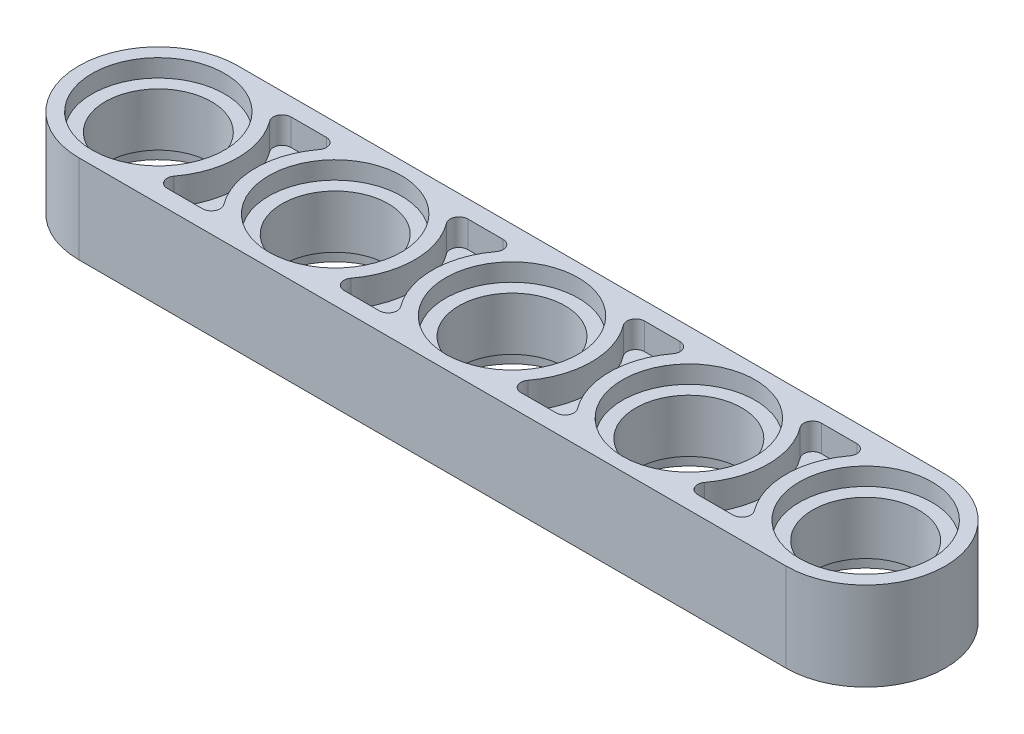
ISO-10303-21;
HEADER;
FILE_DESCRIPTION(('STEP AP214'),'2;1');
FILE_NAME('part.step','',(''),(''),'','','');
FILE_SCHEMA(('AUTOMOTIVE_DESIGN { 1 0 10303 214 1 1 1 1 }'));
ENDSEC;
DATA;
#1=APPLICATION_CONTEXT('core data for automotive mechanical design processes');
#2=APPLICATION_PROTOCOL_DEFINITION('international standard','automotive_design',2000,#1);
#3=PRODUCT_CONTEXT('',#1,'mechanical');
#4=PRODUCT('Part','Part','',(#3));
#5=PRODUCT_RELATED_PRODUCT_CATEGORY('part','',(#4));
#6=PRODUCT_DEFINITION_FORMATION('','',#4);
#7=PRODUCT_DEFINITION_CONTEXT('part definition',#1,'design');
#8=PRODUCT_DEFINITION('design','',#6,#7);
#9=PRODUCT_DEFINITION_SHAPE('','',#8);
#10=(LENGTH_UNIT() NAMED_UNIT(*) SI_UNIT(.MILLI.,.METRE.));
#11=(NAMED_UNIT(*) PLANE_ANGLE_UNIT() SI_UNIT($,.RADIAN.));
#12=(NAMED_UNIT(*) SI_UNIT($,.STERADIAN.) SOLID_ANGLE_UNIT());
#13=UNCERTAINTY_MEASURE_WITH_UNIT(LENGTH_MEASURE(1.E-05),#10,'distance_accuracy_value','');
#14=(GEOMETRIC_REPRESENTATION_CONTEXT(3) GLOBAL_UNCERTAINTY_ASSIGNED_CONTEXT((#13)) GLOBAL_UNIT_ASSIGNED_CONTEXT((#10,
#11,#12)) REPRESENTATION_CONTEXT('',''));
#15=CARTESIAN_POINT('',(0.,0.,0.));
#16=DIRECTION('',(0.,0.,1.));
#17=DIRECTION('',(1.,0.,0.));
#18=AXIS2_PLACEMENT_3D('',#15,#16,#17);
#19=CARTESIAN_POINT('',(-16.,-2.,0.));
#20=DIRECTION('',(0.,1.,0.));
#21=DIRECTION('',(0.,0.,1.));
#22=AXIS2_PLACEMENT_3D('',#19,#20,#21);
#23=PLANE('',#22);
#24=CARTESIAN_POINT('',(-3.2,-2.,2.4));
#25=DIRECTION('',(0.,1.,0.));
#26=DIRECTION('',(0.,0.,-1.));
#27=AXIS2_PLACEMENT_3D('',#24,#25,#26);
#28=CIRCLE('',#27,0.4);
#29=CARTESIAN_POINT('',(-3.2,-2.,2.8));
#30=VERTEX_POINT('',#29);
#31=CARTESIAN_POINT('',(-2.88,-2.,2.16));
#32=VERTEX_POINT('',#31);
#33=EDGE_CURVE('E59',#30,#32,#28,.T.);
#34=ORIENTED_EDGE('',*,*,#33,.T.);
#35=CARTESIAN_POINT('',(0.,-2.,0.));
#36=DIRECTION('',(0.,-1.,0.));
#37=DIRECTION('',(0.,0.,1.));
#38=AXIS2_PLACEMENT_3D('',#35,#36,#37);
#39=CIRCLE('',#38,3.6);
#40=CARTESIAN_POINT('',(-2.88,-2.,-2.16));
#41=VERTEX_POINT('',#40);
#42=EDGE_CURVE('E535',#32,#41,#39,.T.);
#43=ORIENTED_EDGE('',*,*,#42,.T.);
#44=CARTESIAN_POINT('',(-3.2,-2.,-2.4));
#45=DIRECTION('',(0.,1.,0.));
#46=DIRECTION('',(0.,0.,1.));
#47=AXIS2_PLACEMENT_3D('',#44,#45,#46);
#48=CIRCLE('',#47,0.400000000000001);
#49=CARTESIAN_POINT('',(-3.2,-2.,-2.8));
#50=VERTEX_POINT('',#49);
#51=EDGE_CURVE('E567',#41,#50,#48,.T.);
#52=ORIENTED_EDGE('',*,*,#51,.T.);
#53=DIRECTION('',(-1.,0.,0.));
#54=VECTOR('',#53,1.);
#55=CARTESIAN_POINT('',(-4.8,-2.,-2.8));
#56=LINE('',#55,#54);
#57=CARTESIAN_POINT('',(-4.8,-2.,-2.8));
#58=VERTEX_POINT('',#57);
#59=EDGE_CURVE('E564',#50,#58,#56,.T.);
#60=ORIENTED_EDGE('',*,*,#59,.T.);
#61=CARTESIAN_POINT('',(-4.8,-2.,-2.4));
#62=DIRECTION('',(0.,1.,0.));
#63=DIRECTION('',(0.,0.,-1.));
#64=AXIS2_PLACEMENT_3D('',#61,#62,#63);
#65=CIRCLE('',#64,0.400000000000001);
#66=CARTESIAN_POINT('',(-5.12,-2.,-2.16));
#67=VERTEX_POINT('',#66);
#68=EDGE_CURVE('E561',#58,#67,#65,.T.);
#69=ORIENTED_EDGE('',*,*,#68,.T.);
#70=CARTESIAN_POINT('',(-8.,-2.,0.));
#71=DIRECTION('',(0.,-1.,0.));
#72=DIRECTION('',(0.,0.,1.));
#73=AXIS2_PLACEMENT_3D('',#70,#71,#72);
#74=CIRCLE('',#73,3.6);
#75=CARTESIAN_POINT('',(-5.12,-2.,2.16));
#76=VERTEX_POINT('',#75);
#77=EDGE_CURVE('E558',#67,#76,#74,.T.);
#78=ORIENTED_EDGE('',*,*,#77,.T.);
#79=CARTESIAN_POINT('',(-4.8,-2.,2.4));
#80=DIRECTION('',(0.,1.,0.));
#81=DIRECTION('',(0.,0.,1.));
#82=AXIS2_PLACEMENT_3D('',#79,#80,#81);
#83=CIRCLE('',#82,0.4);
#84=CARTESIAN_POINT('',(-4.8,-2.,2.8));
#85=VERTEX_POINT('',#84);
#86=EDGE_CURVE('E555',#76,#85,#83,.T.);
#87=ORIENTED_EDGE('',*,*,#86,.T.);
#88=DIRECTION('',(1.,0.,0.));
#89=VECTOR('',#88,1.);
#90=CARTESIAN_POINT('',(-4.8,-2.,2.8));
#91=LINE('',#90,#89);
#92=EDGE_CURVE('E551',#85,#30,#91,.T.);
#93=ORIENTED_EDGE('',*,*,#92,.T.);
#94=EDGE_LOOP('',(#34,#43,#52,#60,#69,#78,#87,#93));
#95=FACE_BOUND('',#94,.T.);
#96=CARTESIAN_POINT('',(12.8,-2.,2.4));
#97=DIRECTION('',(0.,1.,0.));
#98=DIRECTION('',(0.,0.,-1.));
#99=AXIS2_PLACEMENT_3D('',#96,#97,#98);
#100=CIRCLE('',#99,0.4);
#101=CARTESIAN_POINT('',(12.8,-2.,2.8));
#102=VERTEX_POINT('',#101);
#103=CARTESIAN_POINT('',(13.12,-2.,2.16));
#104=VERTEX_POINT('',#103);
#105=EDGE_CURVE('E664',#102,#104,#100,.T.);
#106=ORIENTED_EDGE('',*,*,#105,.T.);
#107=CARTESIAN_POINT('',(16.,-2.,0.));
#108=DIRECTION('',(0.,-1.,0.));
#109=DIRECTION('',(0.,0.,1.));
#110=AXIS2_PLACEMENT_3D('',#107,#108,#109);
#111=CIRCLE('',#110,3.6);
#112=CARTESIAN_POINT('',(13.12,-2.,-2.16));
#113=VERTEX_POINT('',#112);
#114=EDGE_CURVE('E649',#104,#113,#111,.T.);
#115=ORIENTED_EDGE('',*,*,#114,.T.);
#116=CARTESIAN_POINT('',(12.8,-2.,-2.4));
#117=DIRECTION('',(0.,1.,0.));
#118=DIRECTION('',(0.,0.,1.));
#119=AXIS2_PLACEMENT_3D('',#116,#117,#118);
#120=CIRCLE('',#119,0.400000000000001);
#121=CARTESIAN_POINT('',(12.8,-2.,-2.8));
#122=VERTEX_POINT('',#121);
#123=EDGE_CURVE('E682',#113,#122,#120,.T.);
#124=ORIENTED_EDGE('',*,*,#123,.T.);
#125=DIRECTION('',(-1.,0.,0.));
#126=VECTOR('',#125,1.);
#127=CARTESIAN_POINT('',(11.2,-2.,-2.8));
#128=LINE('',#127,#126);
#129=CARTESIAN_POINT('',(11.2,-2.,-2.8));
#130=VERTEX_POINT('',#129);
#131=EDGE_CURVE('E679',#122,#130,#128,.T.);
#132=ORIENTED_EDGE('',*,*,#131,.T.);
#133=CARTESIAN_POINT('',(11.2,-2.,-2.4));
#134=DIRECTION('',(0.,1.,0.));
#135=DIRECTION('',(0.,0.,-1.));
#136=AXIS2_PLACEMENT_3D('',#133,#134,#135);
#137=CIRCLE('',#136,0.400000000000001);
#138=CARTESIAN_POINT('',(10.88,-2.,-2.16));
#139=VERTEX_POINT('',#138);
#140=EDGE_CURVE('E676',#130,#139,#137,.T.);
#141=ORIENTED_EDGE('',*,*,#140,.T.);
#142=CARTESIAN_POINT('',(8.,-2.,0.));
#143=DIRECTION('',(0.,-1.,0.));
#144=DIRECTION('',(0.,0.,1.));
#145=AXIS2_PLACEMENT_3D('',#142,#143,#144);
#146=CIRCLE('',#145,3.6);
#147=CARTESIAN_POINT('',(10.88,-2.,2.16));
#148=VERTEX_POINT('',#147);
#149=EDGE_CURVE('E673',#139,#148,#146,.T.);
#150=ORIENTED_EDGE('',*,*,#149,.T.);
#151=CARTESIAN_POINT('',(11.2,-2.,2.4));
#152=DIRECTION('',(0.,1.,0.));
#153=DIRECTION('',(0.,0.,1.));
#154=AXIS2_PLACEMENT_3D('',#151,#152,#153);
#155=CIRCLE('',#154,0.4);
#156=CARTESIAN_POINT('',(11.2,-2.,2.8));
#157=VERTEX_POINT('',#156);
#158=EDGE_CURVE('E670',#148,#157,#155,.T.);
#159=ORIENTED_EDGE('',*,*,#158,.T.);
#160=DIRECTION('',(1.,0.,0.));
#161=VECTOR('',#160,1.);
#162=CARTESIAN_POINT('',(11.2,-2.,2.8));
#163=LINE('',#162,#161);
#164=EDGE_CURVE('E667',#157,#102,#163,.T.);
#165=ORIENTED_EDGE('',*,*,#164,.T.);
#166=EDGE_LOOP('',(#106,#115,#124,#132,#141,#150,#159,#165));
#167=FACE_BOUND('',#166,.T.);
#168=CARTESIAN_POINT('',(-16.,-2.,0.));
#169=DIRECTION('',(0.,1.,0.));
#170=DIRECTION('',(0.,0.,1.));
#171=AXIS2_PLACEMENT_3D('',#168,#169,#170);
#172=CIRCLE('',#171,3.);
#173=CARTESIAN_POINT('',(-16.,-2.,3.));
#174=VERTEX_POINT('',#173);
#175=EDGE_CURVE('E707',#174,#174,#172,.T.);
#176=ORIENTED_EDGE('',*,*,#175,.T.);
#177=EDGE_LOOP('',(#176));
#178=FACE_BOUND('',#177,.T.);
#179=CARTESIAN_POINT('',(-8.,-2.,0.));
#180=DIRECTION('',(0.,1.,0.));
#181=DIRECTION('',(0.,0.,1.));
#182=AXIS2_PLACEMENT_3D('',#179,#180,#181);
#183=CIRCLE('',#182,3.);
#184=CARTESIAN_POINT('',(-8.,-2.,3.));
#185=VERTEX_POINT('',#184);
#186=EDGE_CURVE('E713',#185,#185,#183,.T.);
#187=ORIENTED_EDGE('',*,*,#186,.T.);
#188=EDGE_LOOP('',(#187));
#189=FACE_BOUND('',#188,.T.);
#190=CARTESIAN_POINT('',(0.,-2.,0.));
#191=DIRECTION('',(0.,1.,0.));
#192=DIRECTION('',(0.,0.,1.));
#193=AXIS2_PLACEMENT_3D('',#190,#191,#192);
#194=CIRCLE('',#193,3.);
#195=CARTESIAN_POINT('',(0.,-2.,3.));
#196=VERTEX_POINT('',#195);
#197=EDGE_CURVE('E719',#196,#196,#194,.T.);
#198=ORIENTED_EDGE('',*,*,#197,.T.);
#199=EDGE_LOOP('',(#198));
#200=FACE_BOUND('',#199,.T.);
#201=CARTESIAN_POINT('',(8.,-2.,0.));
#202=DIRECTION('',(0.,1.,0.));
#203=DIRECTION('',(0.,0.,1.));
#204=AXIS2_PLACEMENT_3D('',#201,#202,#203);
#205=CIRCLE('',#204,3.);
#206=CARTESIAN_POINT('',(8.,-2.,3.));
#207=VERTEX_POINT('',#206);
#208=EDGE_CURVE('E725',#207,#207,#205,.T.);
#209=ORIENTED_EDGE('',*,*,#208,.T.);
#210=EDGE_LOOP('',(#209));
#211=FACE_BOUND('',#210,.T.);
#212=CARTESIAN_POINT('',(16.,-2.,0.));
#213=DIRECTION('',(0.,1.,0.));
#214=DIRECTION('',(0.,0.,1.));
#215=AXIS2_PLACEMENT_3D('',#212,#213,#214);
#216=CIRCLE('',#215,3.);
#217=CARTESIAN_POINT('',(16.,-2.,3.));
#218=VERTEX_POINT('',#217);
#219=EDGE_CURVE('E519',#218,#218,#216,.T.);
#220=ORIENTED_EDGE('',*,*,#219,.T.);
#221=EDGE_LOOP('',(#220));
#222=FACE_BOUND('',#221,.T.);
#223=CARTESIAN_POINT('',(-16.,-2.,0.));
#224=DIRECTION('',(0.,1.,0.));
#225=DIRECTION('',(0.,0.,1.));
#226=AXIS2_PLACEMENT_3D('',#223,#224,#225);
#227=CIRCLE('',#226,3.6);
#228=CARTESIAN_POINT('',(-16.,-2.,-3.6));
#229=VERTEX_POINT('',#228);
#230=CARTESIAN_POINT('',(-16.,-2.,3.6));
#231=VERTEX_POINT('',#230);
#232=EDGE_CURVE('E1033',#229,#231,#227,.T.);
#233=ORIENTED_EDGE('',*,*,#232,.F.);
#234=DIRECTION('',(-1.,0.,0.));
#235=VECTOR('',#234,1.);
#236=CARTESIAN_POINT('',(-16.,-2.,-3.6));
#237=LINE('',#236,#235);
#238=CARTESIAN_POINT('',(16.,-2.,-3.6));
#239=VERTEX_POINT('',#238);
#240=EDGE_CURVE('E1042',#239,#229,#237,.T.);
#241=ORIENTED_EDGE('',*,*,#240,.F.);
#242=CARTESIAN_POINT('',(16.,-2.,0.));
#243=DIRECTION('',(0.,1.,0.));
#244=DIRECTION('',(0.,0.,1.));
#245=AXIS2_PLACEMENT_3D('',#242,#243,#244);
#246=CIRCLE('',#245,3.6);
#247=CARTESIAN_POINT('',(16.,-2.,3.6));
#248=VERTEX_POINT('',#247);
#249=EDGE_CURVE('E1039',#248,#239,#246,.T.);
#250=ORIENTED_EDGE('',*,*,#249,.F.);
#251=DIRECTION('',(1.,0.,0.));
#252=VECTOR('',#251,1.);
#253=CARTESIAN_POINT('',(-16.,-2.,3.6));
#254=LINE('',#253,#252);
#255=EDGE_CURVE('E1036',#231,#248,#254,.T.);
#256=ORIENTED_EDGE('',*,*,#255,.F.);
#257=EDGE_LOOP('',(#233,#241,#250,#256));
#258=FACE_BOUND('',#257,.T.);
#259=CARTESIAN_POINT('',(4.8,-2.,2.4));
#260=DIRECTION('',(0.,1.,0.));
#261=DIRECTION('',(0.,0.,-1.));
#262=AXIS2_PLACEMENT_3D('',#259,#260,#261);
#263=CIRCLE('',#262,0.4);
#264=CARTESIAN_POINT('',(4.8,-2.,2.8));
#265=VERTEX_POINT('',#264);
#266=CARTESIAN_POINT('',(5.12,-2.,2.16));
#267=VERTEX_POINT('',#266);
#268=EDGE_CURVE('E605',#265,#267,#263,.T.);
#269=ORIENTED_EDGE('',*,*,#268,.T.);
#270=CARTESIAN_POINT('',(8.,-2.,0.));
#271=DIRECTION('',(0.,-1.,0.));
#272=DIRECTION('',(0.,0.,1.));
#273=AXIS2_PLACEMENT_3D('',#270,#271,#272);
#274=CIRCLE('',#273,3.6);
#275=CARTESIAN_POINT('',(5.12,-2.,-2.16));
#276=VERTEX_POINT('',#275);
#277=EDGE_CURVE('E590',#267,#276,#274,.T.);
#278=ORIENTED_EDGE('',*,*,#277,.T.);
#279=CARTESIAN_POINT('',(4.8,-2.,-2.4));
#280=DIRECTION('',(0.,1.,0.));
#281=DIRECTION('',(0.,0.,1.));
#282=AXIS2_PLACEMENT_3D('',#279,#280,#281);
#283=CIRCLE('',#282,0.400000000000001);
#284=CARTESIAN_POINT('',(4.8,-2.,-2.8));
#285=VERTEX_POINT('',#284);
#286=EDGE_CURVE('E624',#276,#285,#283,.T.);
#287=ORIENTED_EDGE('',*,*,#286,.T.);
#288=DIRECTION('',(-1.,0.,0.));
#289=VECTOR('',#288,1.);
#290=CARTESIAN_POINT('',(3.2,-2.,-2.8));
#291=LINE('',#290,#289);
#292=CARTESIAN_POINT('',(3.2,-2.,-2.8));
#293=VERTEX_POINT('',#292);
#294=EDGE_CURVE('E621',#285,#293,#291,.T.);
#295=ORIENTED_EDGE('',*,*,#294,.T.);
#296=CARTESIAN_POINT('',(3.2,-2.,-2.4));
#297=DIRECTION('',(0.,1.,0.));
#298=DIRECTION('',(0.,0.,-1.));
#299=AXIS2_PLACEMENT_3D('',#296,#297,#298);
#300=CIRCLE('',#299,0.400000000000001);
#301=CARTESIAN_POINT('',(2.88,-2.,-2.16));
#302=VERTEX_POINT('',#301);
#303=EDGE_CURVE('E618',#293,#302,#300,.T.);
#304=ORIENTED_EDGE('',*,*,#303,.T.);
#305=CARTESIAN_POINT('',(0.,-2.,0.));
#306=DIRECTION('',(0.,-1.,0.));
#307=DIRECTION('',(0.,0.,1.));
#308=AXIS2_PLACEMENT_3D('',#305,#306,#307);
#309=CIRCLE('',#308,3.6);
#310=CARTESIAN_POINT('',(2.88,-2.,2.16));
#311=VERTEX_POINT('',#310);
#312=EDGE_CURVE('E615',#302,#311,#309,.T.);
#313=ORIENTED_EDGE('',*,*,#312,.T.);
#314=CARTESIAN_POINT('',(3.2,-2.,2.4));
#315=DIRECTION('',(0.,1.,0.));
#316=DIRECTION('',(0.,0.,1.));
#317=AXIS2_PLACEMENT_3D('',#314,#315,#316);
#318=CIRCLE('',#317,0.4);
#319=CARTESIAN_POINT('',(3.2,-2.,2.8));
#320=VERTEX_POINT('',#319);
#321=EDGE_CURVE('E612',#311,#320,#318,.T.);
#322=ORIENTED_EDGE('',*,*,#321,.T.);
#323=DIRECTION('',(1.,0.,0.));
#324=VECTOR('',#323,1.);
#325=CARTESIAN_POINT('',(3.2,-2.,2.8));
#326=LINE('',#325,#324);
#327=EDGE_CURVE('E608',#320,#265,#326,.T.);
#328=ORIENTED_EDGE('',*,*,#327,.T.);
#329=EDGE_LOOP('',(#269,#278,#287,#295,#304,#313,#322,#328));
#330=FACE_BOUND('',#329,.T.);
#331=CARTESIAN_POINT('',(-11.2,-2.,2.4));
#332=DIRECTION('',(0.,1.,0.));
#333=DIRECTION('',(0.,0.,-1.));
#334=AXIS2_PLACEMENT_3D('',#331,#332,#333);
#335=CIRCLE('',#334,0.4);
#336=CARTESIAN_POINT('',(-11.2,-2.,2.8));
#337=VERTEX_POINT('',#336);
#338=CARTESIAN_POINT('',(-10.88,-2.,2.16));
#339=VERTEX_POINT('',#338);
#340=EDGE_CURVE('E51',#337,#339,#335,.T.);
#341=ORIENTED_EDGE('',*,*,#340,.T.);
#342=CARTESIAN_POINT('',(-8.,-2.,0.));
#343=DIRECTION('',(0.,-1.,0.));
#344=DIRECTION('',(0.,0.,1.));
#345=AXIS2_PLACEMENT_3D('',#342,#343,#344);
#346=CIRCLE('',#345,3.6);
#347=CARTESIAN_POINT('',(-10.88,-2.,-2.16));
#348=VERTEX_POINT('',#347);
#349=EDGE_CURVE('E483',#339,#348,#346,.T.);
#350=ORIENTED_EDGE('',*,*,#349,.T.);
#351=CARTESIAN_POINT('',(-11.2,-2.,-2.4));
#352=DIRECTION('',(0.,1.,0.));
#353=DIRECTION('',(0.,0.,1.));
#354=AXIS2_PLACEMENT_3D('',#351,#352,#353);
#355=CIRCLE('',#354,0.400000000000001);
#356=CARTESIAN_POINT('',(-11.2,-2.,-2.8));
#357=VERTEX_POINT('',#356);
#358=EDGE_CURVE('E486',#348,#357,#355,.T.);
#359=ORIENTED_EDGE('',*,*,#358,.T.);
#360=DIRECTION('',(-1.,0.,0.));
#361=VECTOR('',#360,1.);
#362=CARTESIAN_POINT('',(-12.8,-2.,-2.8));
#363=LINE('',#362,#361);
#364=CARTESIAN_POINT('',(-12.8,-2.,-2.8));
#365=VERTEX_POINT('',#364);
#366=EDGE_CURVE('E512',#357,#365,#363,.T.);
#367=ORIENTED_EDGE('',*,*,#366,.T.);
#368=CARTESIAN_POINT('',(-12.8,-2.,-2.4));
#369=DIRECTION('',(0.,1.,0.));
#370=DIRECTION('',(0.,0.,-1.));
#371=AXIS2_PLACEMENT_3D('',#368,#369,#370);
#372=CIRCLE('',#371,0.400000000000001);
#373=CARTESIAN_POINT('',(-13.12,-2.,-2.16));
#374=VERTEX_POINT('',#373);
#375=EDGE_CURVE('E509',#365,#374,#372,.T.);
#376=ORIENTED_EDGE('',*,*,#375,.T.);
#377=CARTESIAN_POINT('',(-16.,-2.,0.));
#378=DIRECTION('',(0.,-1.,0.));
#379=DIRECTION('',(0.,0.,1.));
#380=AXIS2_PLACEMENT_3D('',#377,#378,#379);
#381=CIRCLE('',#380,3.6);
#382=CARTESIAN_POINT('',(-13.12,-2.,2.16));
#383=VERTEX_POINT('',#382);
#384=EDGE_CURVE('E506',#374,#383,#381,.T.);
#385=ORIENTED_EDGE('',*,*,#384,.T.);
#386=CARTESIAN_POINT('',(-12.8,-2.,2.4));
#387=DIRECTION('',(0.,1.,0.));
#388=DIRECTION('',(0.,0.,1.));
#389=AXIS2_PLACEMENT_3D('',#386,#387,#388);
#390=CIRCLE('',#389,0.4);
#391=CARTESIAN_POINT('',(-12.8,-2.,2.8));
#392=VERTEX_POINT('',#391);
#393=EDGE_CURVE('E503',#383,#392,#390,.T.);
#394=ORIENTED_EDGE('',*,*,#393,.T.);
#395=DIRECTION('',(1.,0.,0.));
#396=VECTOR('',#395,1.);
#397=CARTESIAN_POINT('',(-12.8,-2.,2.8));
#398=LINE('',#397,#396);
#399=EDGE_CURVE('E500',#392,#337,#398,.T.);
#400=ORIENTED_EDGE('',*,*,#399,.T.);
#401=EDGE_LOOP('',(#341,#350,#359,#367,#376,#385,#394,#400));
#402=FACE_BOUND('',#401,.T.);
#403=ADVANCED_FACE('F34',(#95,#167,#178,#189,#200,#211,#222,#258,#330,#402),#23,.F.);
#404=CARTESIAN_POINT('',(16.,-2.,0.));
#405=DIRECTION('',(0.,1.,0.));
#406=DIRECTION('',(0.,0.,1.));
#407=AXIS2_PLACEMENT_3D('',#404,#405,#406);
#408=CYLINDRICAL_SURFACE('',#407,2.4);
#409=CARTESIAN_POINT('',(16.,1.2,0.));
#410=DIRECTION('',(0.,1.,0.));
#411=DIRECTION('',(0.,0.,1.));
#412=AXIS2_PLACEMENT_3D('',#409,#410,#411);
#413=CIRCLE('',#412,2.4);
#414=CARTESIAN_POINT('',(16.,1.2,2.4));
#415=VERTEX_POINT('',#414);
#416=EDGE_CURVE('E1024',#415,#415,#413,.F.);
#417=ORIENTED_EDGE('',*,*,#416,.F.);
#418=EDGE_LOOP('',(#417));
#419=FACE_BOUND('',#418,.T.);
#420=CARTESIAN_POINT('',(16.,-1.2,0.));
#421=DIRECTION('',(0.,-1.,0.));
#422=DIRECTION('',(0.,0.,-1.));
#423=AXIS2_PLACEMENT_3D('',#420,#421,#422);
#424=CIRCLE('',#423,2.4);
#425=CARTESIAN_POINT('',(16.,-1.2,-2.4));
#426=VERTEX_POINT('',#425);
#427=EDGE_CURVE('E38',#426,#426,#424,.F.);
#428=ORIENTED_EDGE('',*,*,#427,.F.);
#429=EDGE_LOOP('',(#428));
#430=FACE_BOUND('',#429,.T.);
#431=ADVANCED_FACE('F1079',(#419,#430),#408,.F.);
#432=CARTESIAN_POINT('',(8.,-2.,0.));
#433=DIRECTION('',(0.,1.,0.));
#434=DIRECTION('',(0.,0.,1.));
#435=AXIS2_PLACEMENT_3D('',#432,#433,#434);
#436=CYLINDRICAL_SURFACE('',#435,2.4);
#437=CARTESIAN_POINT('',(8.,1.2,0.));
#438=DIRECTION('',(0.,1.,0.));
#439=DIRECTION('',(0.,0.,1.));
#440=AXIS2_PLACEMENT_3D('',#437,#438,#439);
#441=CIRCLE('',#440,2.4);
#442=CARTESIAN_POINT('',(8.,1.2,2.4));
#443=VERTEX_POINT('',#442);
#444=EDGE_CURVE('E1058',#443,#443,#441,.F.);
#445=ORIENTED_EDGE('',*,*,#444,.F.);
#446=EDGE_LOOP('',(#445));
#447=FACE_BOUND('',#446,.T.);
#448=CARTESIAN_POINT('',(8.,-1.2,0.));
#449=DIRECTION('',(0.,-1.,0.));
#450=DIRECTION('',(0.,0.,-1.));
#451=AXIS2_PLACEMENT_3D('',#448,#449,#450);
#452=CIRCLE('',#451,2.4);
#453=CARTESIAN_POINT('',(8.,-1.2,-2.4));
#454=VERTEX_POINT('',#453);
#455=EDGE_CURVE('E1070',#454,#454,#452,.F.);
#456=ORIENTED_EDGE('',*,*,#455,.F.);
#457=EDGE_LOOP('',(#456));
#458=FACE_BOUND('',#457,.T.);
#459=ADVANCED_FACE('F1081',(#447,#458),#436,.F.);
#460=CARTESIAN_POINT('',(0.,-2.,0.));
#461=DIRECTION('',(0.,1.,0.));
#462=DIRECTION('',(0.,0.,1.));
#463=AXIS2_PLACEMENT_3D('',#460,#461,#462);
#464=CYLINDRICAL_SURFACE('',#463,2.4);
#465=CARTESIAN_POINT('',(0.,1.2,0.));
#466=DIRECTION('',(0.,1.,0.));
#467=DIRECTION('',(0.,0.,1.));
#468=AXIS2_PLACEMENT_3D('',#465,#466,#467);
#469=CIRCLE('',#468,2.4);
#470=CARTESIAN_POINT('',(0.,1.2,2.4));
#471=VERTEX_POINT('',#470);
#472=EDGE_CURVE('E1055',#471,#471,#469,.F.);
#473=ORIENTED_EDGE('',*,*,#472,.F.);
#474=EDGE_LOOP('',(#473));
#475=FACE_BOUND('',#474,.T.);
#476=CARTESIAN_POINT('',(0.,-1.2,0.));
#477=DIRECTION('',(0.,-1.,0.));
#478=DIRECTION('',(0.,0.,-1.));
#479=AXIS2_PLACEMENT_3D('',#476,#477,#478);
#480=CIRCLE('',#479,2.4);
#481=CARTESIAN_POINT('',(0.,-1.2,-2.4));
#482=VERTEX_POINT('',#481);
#483=EDGE_CURVE('E1068',#482,#482,#480,.F.);
#484=ORIENTED_EDGE('',*,*,#483,.F.);
#485=EDGE_LOOP('',(#484));
#486=FACE_BOUND('',#485,.T.);
#487=ADVANCED_FACE('F1088',(#475,#486),#464,.F.);
#488=CARTESIAN_POINT('',(-8.,-2.,0.));
#489=DIRECTION('',(0.,1.,0.));
#490=DIRECTION('',(0.,0.,1.));
#491=AXIS2_PLACEMENT_3D('',#488,#489,#490);
#492=CYLINDRICAL_SURFACE('',#491,2.4);
#493=CARTESIAN_POINT('',(-8.,1.2,0.));
#494=DIRECTION('',(0.,1.,0.));
#495=DIRECTION('',(0.,0.,1.));
#496=AXIS2_PLACEMENT_3D('',#493,#494,#495);
#497=CIRCLE('',#496,2.4);
#498=CARTESIAN_POINT('',(-8.,1.2,2.4));
#499=VERTEX_POINT('',#498);
#500=EDGE_CURVE('E1052',#499,#499,#497,.F.);
#501=ORIENTED_EDGE('',*,*,#500,.F.);
#502=EDGE_LOOP('',(#501));
#503=FACE_BOUND('',#502,.T.);
#504=CARTESIAN_POINT('',(-8.,-1.2,0.));
#505=DIRECTION('',(0.,-1.,0.));
#506=DIRECTION('',(0.,0.,-1.));
#507=AXIS2_PLACEMENT_3D('',#504,#505,#506);
#508=CIRCLE('',#507,2.4);
#509=CARTESIAN_POINT('',(-8.,-1.2,-2.4));
#510=VERTEX_POINT('',#509);
#511=EDGE_CURVE('E1065',#510,#510,#508,.F.);
#512=ORIENTED_EDGE('',*,*,#511,.F.);
#513=EDGE_LOOP('',(#512));
#514=FACE_BOUND('',#513,.T.);
#515=ADVANCED_FACE('F1504',(#503,#514),#492,.F.);
#516=CARTESIAN_POINT('',(-16.,-2.,0.));
#517=DIRECTION('',(0.,1.,0.));
#518=DIRECTION('',(0.,0.,1.));
#519=AXIS2_PLACEMENT_3D('',#516,#517,#518);
#520=CYLINDRICAL_SURFACE('',#519,2.4);
#521=CARTESIAN_POINT('',(-16.,1.2,0.));
#522=DIRECTION('',(0.,1.,0.));
#523=DIRECTION('',(0.,0.,1.));
#524=AXIS2_PLACEMENT_3D('',#521,#522,#523);
#525=CIRCLE('',#524,2.4);
#526=CARTESIAN_POINT('',(-16.,1.2,2.4));
#527=VERTEX_POINT('',#526);
#528=EDGE_CURVE('E993',#527,#527,#525,.F.);
#529=ORIENTED_EDGE('',*,*,#528,.F.);
#530=EDGE_LOOP('',(#529));
#531=FACE_BOUND('',#530,.T.);
#532=CARTESIAN_POINT('',(-16.,-1.2,0.));
#533=DIRECTION('',(0.,-1.,0.));
#534=DIRECTION('',(0.,0.,-1.));
#535=AXIS2_PLACEMENT_3D('',#532,#533,#534);
#536=CIRCLE('',#535,2.4);
#537=CARTESIAN_POINT('',(-16.,-1.2,-2.4));
#538=VERTEX_POINT('',#537);
#539=EDGE_CURVE('E706',#538,#538,#536,.F.);
#540=ORIENTED_EDGE('',*,*,#539,.F.);
#541=EDGE_LOOP('',(#540));
#542=FACE_BOUND('',#541,.T.);
#543=ADVANCED_FACE('F1098',(#531,#542),#520,.F.);
#544=CARTESIAN_POINT('',(-16.,2.,0.));
#545=DIRECTION('',(0.,1.,0.));
#546=DIRECTION('',(0.,0.,1.));
#547=AXIS2_PLACEMENT_3D('',#544,#545,#546);
#548=PLANE('',#547);
#549=CARTESIAN_POINT('',(-3.2,2.,2.4));
#550=DIRECTION('',(0.,1.,0.));
#551=DIRECTION('',(0.,0.,-1.));
#552=AXIS2_PLACEMENT_3D('',#549,#550,#551);
#553=CIRCLE('',#552,0.4);
#554=CARTESIAN_POINT('',(-3.2,2.,2.8));
#555=VERTEX_POINT('',#554);
#556=CARTESIAN_POINT('',(-2.88,2.,2.16));
#557=VERTEX_POINT('',#556);
#558=EDGE_CURVE('E825',#555,#557,#553,.T.);
#559=ORIENTED_EDGE('',*,*,#558,.F.);
#560=DIRECTION('',(1.,0.,0.));
#561=VECTOR('',#560,1.);
#562=CARTESIAN_POINT('',(-4.8,2.,2.8));
#563=LINE('',#562,#561);
#564=CARTESIAN_POINT('',(-4.8,2.,2.8));
#565=VERTEX_POINT('',#564);
#566=EDGE_CURVE('E803',#565,#555,#563,.T.);
#567=ORIENTED_EDGE('',*,*,#566,.F.);
#568=CARTESIAN_POINT('',(-4.8,2.,2.4));
#569=DIRECTION('',(0.,1.,0.));
#570=DIRECTION('',(0.,0.,1.));
#571=AXIS2_PLACEMENT_3D('',#568,#569,#570);
#572=CIRCLE('',#571,0.4);
#573=CARTESIAN_POINT('',(-5.12,2.,2.16));
#574=VERTEX_POINT('',#573);
#575=EDGE_CURVE('E843',#574,#565,#572,.T.);
#576=ORIENTED_EDGE('',*,*,#575,.F.);
#577=CARTESIAN_POINT('',(-8.,2.,0.));
#578=DIRECTION('',(0.,-1.,0.));
#579=DIRECTION('',(0.,0.,1.));
#580=AXIS2_PLACEMENT_3D('',#577,#578,#579);
#581=CIRCLE('',#580,3.6);
#582=CARTESIAN_POINT('',(-5.12,2.,-2.16));
#583=VERTEX_POINT('',#582);
#584=EDGE_CURVE('E840',#583,#574,#581,.T.);
#585=ORIENTED_EDGE('',*,*,#584,.F.);
#586=CARTESIAN_POINT('',(-4.8,2.,-2.4));
#587=DIRECTION('',(0.,1.,0.));
#588=DIRECTION('',(0.,0.,-1.));
#589=AXIS2_PLACEMENT_3D('',#586,#587,#588);
#590=CIRCLE('',#589,0.400000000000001);
#591=CARTESIAN_POINT('',(-4.8,2.,-2.8));
#592=VERTEX_POINT('',#591);
#593=EDGE_CURVE('E837',#592,#583,#590,.T.);
#594=ORIENTED_EDGE('',*,*,#593,.F.);
#595=DIRECTION('',(-1.,0.,0.));
#596=VECTOR('',#595,1.);
#597=CARTESIAN_POINT('',(-4.8,2.,-2.8));
#598=LINE('',#597,#596);
#599=CARTESIAN_POINT('',(-3.2,2.,-2.8));
#600=VERTEX_POINT('',#599);
#601=EDGE_CURVE('E834',#600,#592,#598,.T.);
#602=ORIENTED_EDGE('',*,*,#601,.F.);
#603=CARTESIAN_POINT('',(-3.2,2.,-2.4));
#604=DIRECTION('',(0.,1.,0.));
#605=DIRECTION('',(0.,0.,1.));
#606=AXIS2_PLACEMENT_3D('',#603,#604,#605);
#607=CIRCLE('',#606,0.400000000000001);
#608=CARTESIAN_POINT('',(-2.88,2.,-2.16));
#609=VERTEX_POINT('',#608);
#610=EDGE_CURVE('E831',#609,#600,#607,.T.);
#611=ORIENTED_EDGE('',*,*,#610,.F.);
#612=CARTESIAN_POINT('',(0.,2.,0.));
#613=DIRECTION('',(0.,-1.,0.));
#614=DIRECTION('',(0.,0.,1.));
#615=AXIS2_PLACEMENT_3D('',#612,#613,#614);
#616=CIRCLE('',#615,3.6);
#617=EDGE_CURVE('E827',#557,#609,#616,.T.);
#618=ORIENTED_EDGE('',*,*,#617,.F.);
#619=EDGE_LOOP('',(#559,#567,#576,#585,#594,#602,#611,#618));
#620=FACE_BOUND('',#619,.T.);
#621=CARTESIAN_POINT('',(12.8,2.,2.4));
#622=DIRECTION('',(0.,1.,0.));
#623=DIRECTION('',(0.,0.,-1.));
#624=AXIS2_PLACEMENT_3D('',#621,#622,#623);
#625=CIRCLE('',#624,0.4);
#626=CARTESIAN_POINT('',(12.8,2.,2.8));
#627=VERTEX_POINT('',#626);
#628=CARTESIAN_POINT('',(13.12,2.,2.16));
#629=VERTEX_POINT('',#628);
#630=EDGE_CURVE('E953',#627,#629,#625,.T.);
#631=ORIENTED_EDGE('',*,*,#630,.F.);
#632=DIRECTION('',(1.,0.,0.));
#633=VECTOR('',#632,1.);
#634=CARTESIAN_POINT('',(11.2,2.,2.8));
#635=LINE('',#634,#633);
#636=CARTESIAN_POINT('',(11.2,2.,2.8));
#637=VERTEX_POINT('',#636);
#638=EDGE_CURVE('E931',#637,#627,#635,.T.);
#639=ORIENTED_EDGE('',*,*,#638,.F.);
#640=CARTESIAN_POINT('',(11.2,2.,2.4));
#641=DIRECTION('',(0.,1.,0.));
#642=DIRECTION('',(0.,0.,1.));
#643=AXIS2_PLACEMENT_3D('',#640,#641,#642);
#644=CIRCLE('',#643,0.4);
#645=CARTESIAN_POINT('',(10.88,2.,2.16));
#646=VERTEX_POINT('',#645);
#647=EDGE_CURVE('E970',#646,#637,#644,.T.);
#648=ORIENTED_EDGE('',*,*,#647,.F.);
#649=CARTESIAN_POINT('',(8.,2.,0.));
#650=DIRECTION('',(0.,-1.,0.));
#651=DIRECTION('',(0.,0.,1.));
#652=AXIS2_PLACEMENT_3D('',#649,#650,#651);
#653=CIRCLE('',#652,3.6);
#654=CARTESIAN_POINT('',(10.88,2.,-2.16));
#655=VERTEX_POINT('',#654);
#656=EDGE_CURVE('E967',#655,#646,#653,.T.);
#657=ORIENTED_EDGE('',*,*,#656,.F.);
#658=CARTESIAN_POINT('',(11.2,2.,-2.4));
#659=DIRECTION('',(0.,1.,0.));
#660=DIRECTION('',(0.,0.,-1.));
#661=AXIS2_PLACEMENT_3D('',#658,#659,#660);
#662=CIRCLE('',#661,0.400000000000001);
#663=CARTESIAN_POINT('',(11.2,2.,-2.8));
#664=VERTEX_POINT('',#663);
#665=EDGE_CURVE('E964',#664,#655,#662,.T.);
#666=ORIENTED_EDGE('',*,*,#665,.F.);
#667=DIRECTION('',(-1.,0.,0.));
#668=VECTOR('',#667,1.);
#669=CARTESIAN_POINT('',(11.2,2.,-2.8));
#670=LINE('',#669,#668);
#671=CARTESIAN_POINT('',(12.8,2.,-2.8));
#672=VERTEX_POINT('',#671);
#673=EDGE_CURVE('E961',#672,#664,#670,.T.);
#674=ORIENTED_EDGE('',*,*,#673,.F.);
#675=CARTESIAN_POINT('',(12.8,2.,-2.4));
#676=DIRECTION('',(0.,1.,0.));
#677=DIRECTION('',(0.,0.,1.));
#678=AXIS2_PLACEMENT_3D('',#675,#676,#677);
#679=CIRCLE('',#678,0.400000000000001);
#680=CARTESIAN_POINT('',(13.12,2.,-2.16));
#681=VERTEX_POINT('',#680);
#682=EDGE_CURVE('E958',#681,#672,#679,.T.);
#683=ORIENTED_EDGE('',*,*,#682,.F.);
#684=CARTESIAN_POINT('',(16.,2.,0.));
#685=DIRECTION('',(0.,-1.,0.));
#686=DIRECTION('',(0.,0.,1.));
#687=AXIS2_PLACEMENT_3D('',#684,#685,#686);
#688=CIRCLE('',#687,3.6);
#689=EDGE_CURVE('E955',#629,#681,#688,.T.);
#690=ORIENTED_EDGE('',*,*,#689,.F.);
#691=EDGE_LOOP('',(#631,#639,#648,#657,#666,#674,#683,#690));
#692=FACE_BOUND('',#691,.T.);
#693=CARTESIAN_POINT('',(-16.,2.,0.));
#694=DIRECTION('',(0.,1.,0.));
#695=DIRECTION('',(0.,0.,1.));
#696=AXIS2_PLACEMENT_3D('',#693,#694,#695);
#697=CIRCLE('',#696,3.);
#698=CARTESIAN_POINT('',(-16.,2.,3.));
#699=VERTEX_POINT('',#698);
#700=EDGE_CURVE('E994',#699,#699,#697,.T.);
#701=ORIENTED_EDGE('',*,*,#700,.F.);
#702=EDGE_LOOP('',(#701));
#703=FACE_BOUND('',#702,.T.);
#704=CARTESIAN_POINT('',(-8.,2.,0.));
#705=DIRECTION('',(0.,1.,0.));
#706=DIRECTION('',(0.,0.,1.));
#707=AXIS2_PLACEMENT_3D('',#704,#705,#706);
#708=CIRCLE('',#707,3.);
#709=CARTESIAN_POINT('',(-8.,2.,3.));
#710=VERTEX_POINT('',#709);
#711=EDGE_CURVE('E1000',#710,#710,#708,.T.);
#712=ORIENTED_EDGE('',*,*,#711,.F.);
#713=EDGE_LOOP('',(#712));
#714=FACE_BOUND('',#713,.T.);
#715=CARTESIAN_POINT('',(0.,2.,0.));
#716=DIRECTION('',(0.,1.,0.));
#717=DIRECTION('',(0.,0.,1.));
#718=AXIS2_PLACEMENT_3D('',#715,#716,#717);
#719=CIRCLE('',#718,3.);
#720=CARTESIAN_POINT('',(0.,2.,3.));
#721=VERTEX_POINT('',#720);
#722=EDGE_CURVE('E1006',#721,#721,#719,.T.);
#723=ORIENTED_EDGE('',*,*,#722,.F.);
#724=EDGE_LOOP('',(#723));
#725=FACE_BOUND('',#724,.T.);
#726=CARTESIAN_POINT('',(8.,2.,0.));
#727=DIRECTION('',(0.,1.,0.));
#728=DIRECTION('',(0.,0.,1.));
#729=AXIS2_PLACEMENT_3D('',#726,#727,#728);
#730=CIRCLE('',#729,3.);
#731=CARTESIAN_POINT('',(8.,2.,3.));
#732=VERTEX_POINT('',#731);
#733=EDGE_CURVE('E1012',#732,#732,#730,.T.);
#734=ORIENTED_EDGE('',*,*,#733,.F.);
#735=EDGE_LOOP('',(#734));
#736=FACE_BOUND('',#735,.T.);
#737=CARTESIAN_POINT('',(16.,2.,0.));
#738=DIRECTION('',(0.,1.,0.));
#739=DIRECTION('',(0.,0.,1.));
#740=AXIS2_PLACEMENT_3D('',#737,#738,#739);
#741=CIRCLE('',#740,3.);
#742=CARTESIAN_POINT('',(16.,2.,3.));
#743=VERTEX_POINT('',#742);
#744=EDGE_CURVE('E784',#743,#743,#741,.T.);
#745=ORIENTED_EDGE('',*,*,#744,.F.);
#746=EDGE_LOOP('',(#745));
#747=FACE_BOUND('',#746,.T.);
#748=CARTESIAN_POINT('',(-16.,2.,0.));
#749=DIRECTION('',(0.,1.,0.));
#750=DIRECTION('',(0.,0.,1.));
#751=AXIS2_PLACEMENT_3D('',#748,#749,#750);
#752=CIRCLE('',#751,3.6);
#753=CARTESIAN_POINT('',(-16.,2.,-3.6));
#754=VERTEX_POINT('',#753);
#755=CARTESIAN_POINT('',(-16.,2.,3.6));
#756=VERTEX_POINT('',#755);
#757=EDGE_CURVE('E1020',#754,#756,#752,.T.);
#758=ORIENTED_EDGE('',*,*,#757,.T.);
#759=DIRECTION('',(1.,0.,0.));
#760=VECTOR('',#759,1.);
#761=CARTESIAN_POINT('',(-16.,2.,3.6));
#762=LINE('',#761,#760);
#763=CARTESIAN_POINT('',(16.,2.,3.6));
#764=VERTEX_POINT('',#763);
#765=EDGE_CURVE('E1023',#756,#764,#762,.T.);
#766=ORIENTED_EDGE('',*,*,#765,.T.);
#767=CARTESIAN_POINT('',(16.,2.,0.));
#768=DIRECTION('',(0.,1.,0.));
#769=DIRECTION('',(0.,0.,1.));
#770=AXIS2_PLACEMENT_3D('',#767,#768,#769);
#771=CIRCLE('',#770,3.6);
#772=CARTESIAN_POINT('',(16.,2.,-3.6));
#773=VERTEX_POINT('',#772);
#774=EDGE_CURVE('E1027',#764,#773,#771,.T.);
#775=ORIENTED_EDGE('',*,*,#774,.T.);
#776=DIRECTION('',(-1.,0.,0.));
#777=VECTOR('',#776,1.);
#778=CARTESIAN_POINT('',(-16.,2.,-3.6));
#779=LINE('',#778,#777);
#780=EDGE_CURVE('E1030',#773,#754,#779,.T.);
#781=ORIENTED_EDGE('',*,*,#780,.T.);
#782=EDGE_LOOP('',(#758,#766,#775,#781));
#783=FACE_BOUND('',#782,.T.);
#784=CARTESIAN_POINT('',(4.8,2.,2.4));
#785=DIRECTION('',(0.,1.,0.));
#786=DIRECTION('',(0.,0.,-1.));
#787=AXIS2_PLACEMENT_3D('',#784,#785,#786);
#788=CIRCLE('',#787,0.4);
#789=CARTESIAN_POINT('',(4.8,2.,2.8));
#790=VERTEX_POINT('',#789);
#791=CARTESIAN_POINT('',(5.12,2.,2.16));
#792=VERTEX_POINT('',#791);
#793=EDGE_CURVE('E889',#790,#792,#788,.T.);
#794=ORIENTED_EDGE('',*,*,#793,.F.);
#795=DIRECTION('',(1.,0.,0.));
#796=VECTOR('',#795,1.);
#797=CARTESIAN_POINT('',(3.2,2.,2.8));
#798=LINE('',#797,#796);
#799=CARTESIAN_POINT('',(3.2,2.,2.8));
#800=VERTEX_POINT('',#799);
#801=EDGE_CURVE('E867',#800,#790,#798,.T.);
#802=ORIENTED_EDGE('',*,*,#801,.F.);
#803=CARTESIAN_POINT('',(3.2,2.,2.4));
#804=DIRECTION('',(0.,1.,0.));
#805=DIRECTION('',(0.,0.,1.));
#806=AXIS2_PLACEMENT_3D('',#803,#804,#805);
#807=CIRCLE('',#806,0.4);
#808=CARTESIAN_POINT('',(2.88,2.,2.16));
#809=VERTEX_POINT('',#808);
#810=EDGE_CURVE('E907',#809,#800,#807,.T.);
#811=ORIENTED_EDGE('',*,*,#810,.F.);
#812=CARTESIAN_POINT('',(0.,2.,0.));
#813=DIRECTION('',(0.,-1.,0.));
#814=DIRECTION('',(0.,0.,1.));
#815=AXIS2_PLACEMENT_3D('',#812,#813,#814);
#816=CIRCLE('',#815,3.6);
#817=CARTESIAN_POINT('',(2.88,2.,-2.16));
#818=VERTEX_POINT('',#817);
#819=EDGE_CURVE('E904',#818,#809,#816,.T.);
#820=ORIENTED_EDGE('',*,*,#819,.F.);
#821=CARTESIAN_POINT('',(3.2,2.,-2.4));
#822=DIRECTION('',(0.,1.,0.));
#823=DIRECTION('',(0.,0.,-1.));
#824=AXIS2_PLACEMENT_3D('',#821,#822,#823);
#825=CIRCLE('',#824,0.400000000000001);
#826=CARTESIAN_POINT('',(3.2,2.,-2.8));
#827=VERTEX_POINT('',#826);
#828=EDGE_CURVE('E901',#827,#818,#825,.T.);
#829=ORIENTED_EDGE('',*,*,#828,.F.);
#830=DIRECTION('',(-1.,0.,0.));
#831=VECTOR('',#830,1.);
#832=CARTESIAN_POINT('',(3.2,2.,-2.8));
#833=LINE('',#832,#831);
#834=CARTESIAN_POINT('',(4.8,2.,-2.8));
#835=VERTEX_POINT('',#834);
#836=EDGE_CURVE('E898',#835,#827,#833,.T.);
#837=ORIENTED_EDGE('',*,*,#836,.F.);
#838=CARTESIAN_POINT('',(4.8,2.,-2.4));
#839=DIRECTION('',(0.,1.,0.));
#840=DIRECTION('',(0.,0.,1.));
#841=AXIS2_PLACEMENT_3D('',#838,#839,#840);
#842=CIRCLE('',#841,0.400000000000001);
#843=CARTESIAN_POINT('',(5.12,2.,-2.16));
#844=VERTEX_POINT('',#843);
#845=EDGE_CURVE('E895',#844,#835,#842,.T.);
#846=ORIENTED_EDGE('',*,*,#845,.F.);
#847=CARTESIAN_POINT('',(8.,2.,0.));
#848=DIRECTION('',(0.,-1.,0.));
#849=DIRECTION('',(0.,0.,1.));
#850=AXIS2_PLACEMENT_3D('',#847,#848,#849);
#851=CIRCLE('',#850,3.6);
#852=EDGE_CURVE('E891',#792,#844,#851,.T.);
#853=ORIENTED_EDGE('',*,*,#852,.F.);
#854=EDGE_LOOP('',(#794,#802,#811,#820,#829,#837,#846,#853));
#855=FACE_BOUND('',#854,.T.);
#856=CARTESIAN_POINT('',(-11.2,2.,2.4));
#857=DIRECTION('',(0.,1.,0.));
#858=DIRECTION('',(0.,0.,-1.));
#859=AXIS2_PLACEMENT_3D('',#856,#857,#858);
#860=CIRCLE('',#859,0.4);
#861=CARTESIAN_POINT('',(-11.2,2.,2.8));
#862=VERTEX_POINT('',#861);
#863=CARTESIAN_POINT('',(-10.88,2.,2.16));
#864=VERTEX_POINT('',#863);
#865=EDGE_CURVE('E759',#862,#864,#860,.T.);
#866=ORIENTED_EDGE('',*,*,#865,.F.);
#867=DIRECTION('',(1.,0.,0.));
#868=VECTOR('',#867,1.);
#869=CARTESIAN_POINT('',(-12.8,2.,2.8));
#870=LINE('',#869,#868);
#871=CARTESIAN_POINT('',(-12.8,2.,2.8));
#872=VERTEX_POINT('',#871);
#873=EDGE_CURVE('E737',#872,#862,#870,.T.);
#874=ORIENTED_EDGE('',*,*,#873,.F.);
#875=CARTESIAN_POINT('',(-12.8,2.,2.4));
#876=DIRECTION('',(0.,1.,0.));
#877=DIRECTION('',(0.,0.,1.));
#878=AXIS2_PLACEMENT_3D('',#875,#876,#877);
#879=CIRCLE('',#878,0.4);
#880=CARTESIAN_POINT('',(-13.12,2.,2.16));
#881=VERTEX_POINT('',#880);
#882=EDGE_CURVE('E777',#881,#872,#879,.T.);
#883=ORIENTED_EDGE('',*,*,#882,.F.);
#884=CARTESIAN_POINT('',(-16.,2.,0.));
#885=DIRECTION('',(0.,-1.,0.));
#886=DIRECTION('',(0.,0.,1.));
#887=AXIS2_PLACEMENT_3D('',#884,#885,#886);
#888=CIRCLE('',#887,3.6);
#889=CARTESIAN_POINT('',(-13.12,2.,-2.16));
#890=VERTEX_POINT('',#889);
#891=EDGE_CURVE('E774',#890,#881,#888,.T.);
#892=ORIENTED_EDGE('',*,*,#891,.F.);
#893=CARTESIAN_POINT('',(-12.8,2.,-2.4));
#894=DIRECTION('',(0.,1.,0.));
#895=DIRECTION('',(0.,0.,-1.));
#896=AXIS2_PLACEMENT_3D('',#893,#894,#895);
#897=CIRCLE('',#896,0.400000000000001);
#898=CARTESIAN_POINT('',(-12.8,2.,-2.8));
#899=VERTEX_POINT('',#898);
#900=EDGE_CURVE('E771',#899,#890,#897,.T.);
#901=ORIENTED_EDGE('',*,*,#900,.F.);
#902=DIRECTION('',(-1.,0.,0.));
#903=VECTOR('',#902,1.);
#904=CARTESIAN_POINT('',(-12.8,2.,-2.8));
#905=LINE('',#904,#903);
#906=CARTESIAN_POINT('',(-11.2,2.,-2.8));
#907=VERTEX_POINT('',#906);
#908=EDGE_CURVE('E768',#907,#899,#905,.T.);
#909=ORIENTED_EDGE('',*,*,#908,.F.);
#910=CARTESIAN_POINT('',(-11.2,2.,-2.4));
#911=DIRECTION('',(0.,1.,0.));
#912=DIRECTION('',(0.,0.,1.));
#913=AXIS2_PLACEMENT_3D('',#910,#911,#912);
#914=CIRCLE('',#913,0.400000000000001);
#915=CARTESIAN_POINT('',(-10.88,2.,-2.16));
#916=VERTEX_POINT('',#915);
#917=EDGE_CURVE('E765',#916,#907,#914,.T.);
#918=ORIENTED_EDGE('',*,*,#917,.F.);
#919=CARTESIAN_POINT('',(-8.,2.,0.));
#920=DIRECTION('',(0.,-1.,0.));
#921=DIRECTION('',(0.,0.,1.));
#922=AXIS2_PLACEMENT_3D('',#919,#920,#921);
#923=CIRCLE('',#922,3.6);
#924=EDGE_CURVE('E761',#864,#916,#923,.T.);
#925=ORIENTED_EDGE('',*,*,#924,.F.);
#926=EDGE_LOOP('',(#866,#874,#883,#892,#901,#909,#918,#925));
#927=FACE_BOUND('',#926,.T.);
#928=ADVANCED_FACE('F1096',(#620,#692,#703,#714,#725,#736,#747,#783,#855,#927),#548,.T.);
#929=CARTESIAN_POINT('',(-16.,-2.,0.));
#930=DIRECTION('',(0.,1.,0.));
#931=DIRECTION('',(0.,0.,1.));
#932=AXIS2_PLACEMENT_3D('',#929,#930,#931);
#933=CYLINDRICAL_SURFACE('',#932,3.6);
#934=DIRECTION('',(0.,1.,0.));
#935=VECTOR('',#934,1.);
#936=CARTESIAN_POINT('',(-16.,-2.,3.6));
#937=LINE('',#936,#935);
#938=EDGE_CURVE('E1044',#231,#756,#937,.T.);
#939=ORIENTED_EDGE('',*,*,#938,.T.);
#940=ORIENTED_EDGE('',*,*,#757,.F.);
#941=DIRECTION('',(0.,1.,0.));
#942=VECTOR('',#941,1.);
#943=CARTESIAN_POINT('',(-16.,-2.,-3.6));
#944=LINE('',#943,#942);
#945=EDGE_CURVE('E11',#229,#754,#944,.T.);
#946=ORIENTED_EDGE('',*,*,#945,.F.);
#947=ORIENTED_EDGE('',*,*,#232,.T.);
#948=EDGE_LOOP('',(#939,#940,#946,#947));
#949=FACE_BOUND('',#948,.T.);
#950=ADVANCED_FACE('F36',(#949),#933,.T.);
#951=CARTESIAN_POINT('',(-16.,-2.,-3.6));
#952=DIRECTION('',(0.,0.,-1.));
#953=DIRECTION('',(-1.,0.,0.));
#954=AXIS2_PLACEMENT_3D('',#951,#952,#953);
#955=PLANE('',#954);
#956=ORIENTED_EDGE('',*,*,#945,.T.);
#957=ORIENTED_EDGE('',*,*,#780,.F.);
#958=DIRECTION('',(0.,1.,0.));
#959=VECTOR('',#958,1.);
#960=CARTESIAN_POINT('',(16.,-2.,-3.6));
#961=LINE('',#960,#959);
#962=EDGE_CURVE('E43',#239,#773,#961,.T.);
#963=ORIENTED_EDGE('',*,*,#962,.F.);
#964=ORIENTED_EDGE('',*,*,#240,.T.);
#965=EDGE_LOOP('',(#956,#957,#963,#964));
#966=FACE_BOUND('',#965,.T.);
#967=ADVANCED_FACE('F1101',(#966),#955,.T.);
#968=CARTESIAN_POINT('',(16.,-2.,0.));
#969=DIRECTION('',(0.,1.,0.));
#970=DIRECTION('',(0.,0.,1.));
#971=AXIS2_PLACEMENT_3D('',#968,#969,#970);
#972=CYLINDRICAL_SURFACE('',#971,3.6);
#973=ORIENTED_EDGE('',*,*,#962,.T.);
#974=ORIENTED_EDGE('',*,*,#774,.F.);
#975=DIRECTION('',(0.,1.,0.));
#976=VECTOR('',#975,1.);
#977=CARTESIAN_POINT('',(16.,-2.,3.6));
#978=LINE('',#977,#976);
#979=EDGE_CURVE('E1047',#248,#764,#978,.T.);
#980=ORIENTED_EDGE('',*,*,#979,.F.);
#981=ORIENTED_EDGE('',*,*,#249,.T.);
#982=EDGE_LOOP('',(#973,#974,#980,#981));
#983=FACE_BOUND('',#982,.T.);
#984=ADVANCED_FACE('F1104',(#983),#972,.T.);
#985=CARTESIAN_POINT('',(-16.,-2.,3.6));
#986=DIRECTION('',(0.,0.,1.));
#987=DIRECTION('',(1.,0.,0.));
#988=AXIS2_PLACEMENT_3D('',#985,#986,#987);
#989=PLANE('',#988);
#990=ORIENTED_EDGE('',*,*,#979,.T.);
#991=ORIENTED_EDGE('',*,*,#765,.F.);
#992=ORIENTED_EDGE('',*,*,#938,.F.);
#993=ORIENTED_EDGE('',*,*,#255,.T.);
#994=EDGE_LOOP('',(#990,#991,#992,#993));
#995=FACE_BOUND('',#994,.T.);
#996=ADVANCED_FACE('F1107',(#995),#989,.T.);
#997=CARTESIAN_POINT('',(-16.,1.2,0.));
#998=DIRECTION('',(0.,1.,0.));
#999=DIRECTION('',(0.,0.,1.));
#1000=AXIS2_PLACEMENT_3D('',#997,#998,#999);
#1001=PLANE('',#1000);
#1002=CARTESIAN_POINT('',(-16.,1.2,0.));
#1003=DIRECTION('',(0.,1.,0.));
#1004=DIRECTION('',(0.,0.,1.));
#1005=AXIS2_PLACEMENT_3D('',#1002,#1003,#1004);
#1006=CIRCLE('',#1005,3.);
#1007=CARTESIAN_POINT('',(-16.,1.2,3.));
#1008=VERTEX_POINT('',#1007);
#1009=EDGE_CURVE('E990',#1008,#1008,#1006,.T.);
#1010=ORIENTED_EDGE('',*,*,#1009,.T.);
#1011=EDGE_LOOP('',(#1010));
#1012=FACE_BOUND('',#1011,.T.);
#1013=ORIENTED_EDGE('',*,*,#528,.T.);
#1014=EDGE_LOOP('',(#1013));
#1015=FACE_BOUND('',#1014,.T.);
#1016=ADVANCED_FACE('F1110',(#1012,#1015),#1001,.T.);
#1017=CARTESIAN_POINT('',(-16.,1.2,0.));
#1018=DIRECTION('',(0.,1.,0.));
#1019=DIRECTION('',(0.,0.,1.));
#1020=AXIS2_PLACEMENT_3D('',#1017,#1018,#1019);
#1021=CYLINDRICAL_SURFACE('',#1020,3.);
#1022=ORIENTED_EDGE('',*,*,#1009,.F.);
#1023=EDGE_LOOP('',(#1022));
#1024=FACE_BOUND('',#1023,.T.);
#1025=ORIENTED_EDGE('',*,*,#700,.T.);
#1026=EDGE_LOOP('',(#1025));
#1027=FACE_BOUND('',#1026,.T.);
#1028=ADVANCED_FACE('F1115',(#1024,#1027),#1021,.F.);
#1029=CARTESIAN_POINT('',(-8.,1.2,0.));
#1030=DIRECTION('',(0.,1.,0.));
#1031=DIRECTION('',(0.,0.,1.));
#1032=AXIS2_PLACEMENT_3D('',#1029,#1030,#1031);
#1033=PLANE('',#1032);
#1034=CARTESIAN_POINT('',(-8.,1.2,0.));
#1035=DIRECTION('',(0.,1.,0.));
#1036=DIRECTION('',(0.,0.,1.));
#1037=AXIS2_PLACEMENT_3D('',#1034,#1035,#1036);
#1038=CIRCLE('',#1037,3.);
#1039=CARTESIAN_POINT('',(-8.,1.2,3.));
#1040=VERTEX_POINT('',#1039);
#1041=EDGE_CURVE('E997',#1040,#1040,#1038,.T.);
#1042=ORIENTED_EDGE('',*,*,#1041,.T.);
#1043=EDGE_LOOP('',(#1042));
#1044=FACE_BOUND('',#1043,.T.);
#1045=ORIENTED_EDGE('',*,*,#500,.T.);
#1046=EDGE_LOOP('',(#1045));
#1047=FACE_BOUND('',#1046,.T.);
#1048=ADVANCED_FACE('F1470',(#1044,#1047),#1033,.T.);
#1049=CARTESIAN_POINT('',(-8.,1.2,0.));
#1050=DIRECTION('',(0.,1.,0.));
#1051=DIRECTION('',(0.,0.,1.));
#1052=AXIS2_PLACEMENT_3D('',#1049,#1050,#1051);
#1053=CYLINDRICAL_SURFACE('',#1052,3.);
#1054=ORIENTED_EDGE('',*,*,#1041,.F.);
#1055=EDGE_LOOP('',(#1054));
#1056=FACE_BOUND('',#1055,.T.);
#1057=ORIENTED_EDGE('',*,*,#711,.T.);
#1058=EDGE_LOOP('',(#1057));
#1059=FACE_BOUND('',#1058,.T.);
#1060=ADVANCED_FACE('F1474',(#1056,#1059),#1053,.F.);
#1061=CARTESIAN_POINT('',(0.,1.2,0.));
#1062=DIRECTION('',(0.,1.,0.));
#1063=DIRECTION('',(0.,0.,1.));
#1064=AXIS2_PLACEMENT_3D('',#1061,#1062,#1063);
#1065=PLANE('',#1064);
#1066=CARTESIAN_POINT('',(0.,1.2,0.));
#1067=DIRECTION('',(0.,1.,0.));
#1068=DIRECTION('',(0.,0.,1.));
#1069=AXIS2_PLACEMENT_3D('',#1066,#1067,#1068);
#1070=CIRCLE('',#1069,3.);
#1071=CARTESIAN_POINT('',(0.,1.2,3.));
#1072=VERTEX_POINT('',#1071);
#1073=EDGE_CURVE('E1003',#1072,#1072,#1070,.T.);
#1074=ORIENTED_EDGE('',*,*,#1073,.T.);
#1075=EDGE_LOOP('',(#1074));
#1076=FACE_BOUND('',#1075,.T.);
#1077=ORIENTED_EDGE('',*,*,#472,.T.);
#1078=EDGE_LOOP('',(#1077));
#1079=FACE_BOUND('',#1078,.T.);
#1080=ADVANCED_FACE('F1478',(#1076,#1079),#1065,.T.);
#1081=CARTESIAN_POINT('',(0.,1.2,0.));
#1082=DIRECTION('',(0.,1.,0.));
#1083=DIRECTION('',(0.,0.,1.));
#1084=AXIS2_PLACEMENT_3D('',#1081,#1082,#1083);
#1085=CYLINDRICAL_SURFACE('',#1084,3.);
#1086=ORIENTED_EDGE('',*,*,#1073,.F.);
#1087=EDGE_LOOP('',(#1086));
#1088=FACE_BOUND('',#1087,.T.);
#1089=ORIENTED_EDGE('',*,*,#722,.T.);
#1090=EDGE_LOOP('',(#1089));
#1091=FACE_BOUND('',#1090,.T.);
#1092=ADVANCED_FACE('F1482',(#1088,#1091),#1085,.F.);
#1093=CARTESIAN_POINT('',(8.,1.2,0.));
#1094=DIRECTION('',(0.,1.,0.));
#1095=DIRECTION('',(0.,0.,1.));
#1096=AXIS2_PLACEMENT_3D('',#1093,#1094,#1095);
#1097=PLANE('',#1096);
#1098=CARTESIAN_POINT('',(8.,1.2,0.));
#1099=DIRECTION('',(0.,1.,0.));
#1100=DIRECTION('',(0.,0.,1.));
#1101=AXIS2_PLACEMENT_3D('',#1098,#1099,#1100);
#1102=CIRCLE('',#1101,3.);
#1103=CARTESIAN_POINT('',(8.,1.2,3.));
#1104=VERTEX_POINT('',#1103);
#1105=EDGE_CURVE('E1009',#1104,#1104,#1102,.T.);
#1106=ORIENTED_EDGE('',*,*,#1105,.T.);
#1107=EDGE_LOOP('',(#1106));
#1108=FACE_BOUND('',#1107,.T.);
#1109=ORIENTED_EDGE('',*,*,#444,.T.);
#1110=EDGE_LOOP('',(#1109));
#1111=FACE_BOUND('',#1110,.T.);
#1112=ADVANCED_FACE('F1486',(#1108,#1111),#1097,.T.);
#1113=CARTESIAN_POINT('',(8.,1.2,0.));
#1114=DIRECTION('',(0.,1.,0.));
#1115=DIRECTION('',(0.,0.,1.));
#1116=AXIS2_PLACEMENT_3D('',#1113,#1114,#1115);
#1117=CYLINDRICAL_SURFACE('',#1116,3.);
#1118=ORIENTED_EDGE('',*,*,#1105,.F.);
#1119=EDGE_LOOP('',(#1118));
#1120=FACE_BOUND('',#1119,.T.);
#1121=ORIENTED_EDGE('',*,*,#733,.T.);
#1122=EDGE_LOOP('',(#1121));
#1123=FACE_BOUND('',#1122,.T.);
#1124=ADVANCED_FACE('F1490',(#1120,#1123),#1117,.F.);
#1125=CARTESIAN_POINT('',(16.,1.2,0.));
#1126=DIRECTION('',(0.,1.,0.));
#1127=DIRECTION('',(0.,0.,1.));
#1128=AXIS2_PLACEMENT_3D('',#1125,#1126,#1127);
#1129=PLANE('',#1128);
#1130=CARTESIAN_POINT('',(16.,1.2,0.));
#1131=DIRECTION('',(0.,1.,0.));
#1132=DIRECTION('',(0.,0.,1.));
#1133=AXIS2_PLACEMENT_3D('',#1130,#1131,#1132);
#1134=CIRCLE('',#1133,3.);
#1135=CARTESIAN_POINT('',(16.,1.2,3.));
#1136=VERTEX_POINT('',#1135);
#1137=EDGE_CURVE('E1015',#1136,#1136,#1134,.T.);
#1138=ORIENTED_EDGE('',*,*,#1137,.T.);
#1139=EDGE_LOOP('',(#1138));
#1140=FACE_BOUND('',#1139,.T.);
#1141=ORIENTED_EDGE('',*,*,#416,.T.);
#1142=EDGE_LOOP('',(#1141));
#1143=FACE_BOUND('',#1142,.T.);
#1144=ADVANCED_FACE('F1494',(#1140,#1143),#1129,.T.);
#1145=CARTESIAN_POINT('',(16.,1.2,0.));
#1146=DIRECTION('',(0.,1.,0.));
#1147=DIRECTION('',(0.,0.,1.));
#1148=AXIS2_PLACEMENT_3D('',#1145,#1146,#1147);
#1149=CYLINDRICAL_SURFACE('',#1148,3.);
#1150=ORIENTED_EDGE('',*,*,#1137,.F.);
#1151=EDGE_LOOP('',(#1150));
#1152=FACE_BOUND('',#1151,.T.);
#1153=ORIENTED_EDGE('',*,*,#744,.T.);
#1154=EDGE_LOOP('',(#1153));
#1155=FACE_BOUND('',#1154,.T.);
#1156=ADVANCED_FACE('F1465',(#1152,#1155),#1149,.F.);
#1157=CARTESIAN_POINT('',(12.8,0.8,2.4));
#1158=DIRECTION('',(0.,1.,0.));
#1159=DIRECTION('',(0.,0.,1.));
#1160=AXIS2_PLACEMENT_3D('',#1157,#1158,#1159);
#1161=CYLINDRICAL_SURFACE('',#1160,0.4);
#1162=ORIENTED_EDGE('',*,*,#630,.T.);
#1163=DIRECTION('',(0.,1.,0.));
#1164=VECTOR('',#1163,1.);
#1165=CARTESIAN_POINT('',(13.12,0.8,2.16));
#1166=LINE('',#1165,#1164);
#1167=CARTESIAN_POINT('',(13.12,0.8,2.16));
#1168=VERTEX_POINT('',#1167);
#1169=EDGE_CURVE('E952',#1168,#629,#1166,.T.);
#1170=ORIENTED_EDGE('',*,*,#1169,.F.);
#1171=CARTESIAN_POINT('',(12.8,0.8,2.4));
#1172=DIRECTION('',(0.,1.,0.));
#1173=DIRECTION('',(0.,0.,-1.));
#1174=AXIS2_PLACEMENT_3D('',#1171,#1172,#1173);
#1175=CIRCLE('',#1174,0.4);
#1176=CARTESIAN_POINT('',(12.8,0.8,2.8));
#1177=VERTEX_POINT('',#1176);
#1178=EDGE_CURVE('E927',#1177,#1168,#1175,.T.);
#1179=ORIENTED_EDGE('',*,*,#1178,.F.);
#1180=DIRECTION('',(0.,1.,0.));
#1181=VECTOR('',#1180,1.);
#1182=CARTESIAN_POINT('',(12.8,0.8,2.8));
#1183=LINE('',#1182,#1181);
#1184=EDGE_CURVE('E892',#1177,#627,#1183,.T.);
#1185=ORIENTED_EDGE('',*,*,#1184,.T.);
#1186=EDGE_LOOP('',(#1162,#1170,#1179,#1185));
#1187=FACE_BOUND('',#1186,.T.);
#1188=ADVANCED_FACE('F1440',(#1187),#1161,.F.);
#1189=CARTESIAN_POINT('',(11.2,0.8,2.8));
#1190=DIRECTION('',(0.,0.,1.));
#1191=DIRECTION('',(1.,0.,0.));
#1192=AXIS2_PLACEMENT_3D('',#1189,#1190,#1191);
#1193=PLANE('',#1192);
#1194=ORIENTED_EDGE('',*,*,#638,.T.);
#1195=ORIENTED_EDGE('',*,*,#1184,.F.);
#1196=DIRECTION('',(1.,0.,0.));
#1197=VECTOR('',#1196,1.);
#1198=CARTESIAN_POINT('',(11.2,0.8,2.8));
#1199=LINE('',#1198,#1197);
#1200=CARTESIAN_POINT('',(11.2,0.8,2.8));
#1201=VERTEX_POINT('',#1200);
#1202=EDGE_CURVE('E949',#1201,#1177,#1199,.T.);
#1203=ORIENTED_EDGE('',*,*,#1202,.F.);
#1204=DIRECTION('',(0.,1.,0.));
#1205=VECTOR('',#1204,1.);
#1206=CARTESIAN_POINT('',(11.2,0.8,2.8));
#1207=LINE('',#1206,#1205);
#1208=EDGE_CURVE('E976',#1201,#637,#1207,.T.);
#1209=ORIENTED_EDGE('',*,*,#1208,.T.);
#1210=EDGE_LOOP('',(#1194,#1195,#1203,#1209));
#1211=FACE_BOUND('',#1210,.T.);
#1212=ADVANCED_FACE('F1436',(#1211),#1193,.F.);
#1213=CARTESIAN_POINT('',(11.2,0.8,2.4));
#1214=DIRECTION('',(0.,1.,0.));
#1215=DIRECTION('',(0.,0.,1.));
#1216=AXIS2_PLACEMENT_3D('',#1213,#1214,#1215);
#1217=CYLINDRICAL_SURFACE('',#1216,0.4);
#1218=ORIENTED_EDGE('',*,*,#647,.T.);
#1219=ORIENTED_EDGE('',*,*,#1208,.F.);
#1220=CARTESIAN_POINT('',(11.2,0.8,2.4));
#1221=DIRECTION('',(0.,1.,0.));
#1222=DIRECTION('',(0.,0.,1.));
#1223=AXIS2_PLACEMENT_3D('',#1220,#1221,#1222);
#1224=CIRCLE('',#1223,0.4);
#1225=CARTESIAN_POINT('',(10.88,0.8,2.16));
#1226=VERTEX_POINT('',#1225);
#1227=EDGE_CURVE('E946',#1226,#1201,#1224,.T.);
#1228=ORIENTED_EDGE('',*,*,#1227,.F.);
#1229=DIRECTION('',(0.,1.,0.));
#1230=VECTOR('',#1229,1.);
#1231=CARTESIAN_POINT('',(10.88,0.8,2.16));
#1232=LINE('',#1231,#1230);
#1233=EDGE_CURVE('E978',#1226,#646,#1232,.T.);
#1234=ORIENTED_EDGE('',*,*,#1233,.T.);
#1235=EDGE_LOOP('',(#1218,#1219,#1228,#1234));
#1236=FACE_BOUND('',#1235,.T.);
#1237=ADVANCED_FACE('F1439',(#1236),#1217,.F.);
#1238=CARTESIAN_POINT('',(8.,0.8,0.));
#1239=DIRECTION('',(0.,1.,0.));
#1240=DIRECTION('',(0.,0.,1.));
#1241=AXIS2_PLACEMENT_3D('',#1238,#1239,#1240);
#1242=CYLINDRICAL_SURFACE('',#1241,3.6);
#1243=ORIENTED_EDGE('',*,*,#656,.T.);
#1244=ORIENTED_EDGE('',*,*,#1233,.F.);
#1245=CARTESIAN_POINT('',(8.,0.8,0.));
#1246=DIRECTION('',(0.,-1.,0.));
#1247=DIRECTION('',(0.,0.,1.));
#1248=AXIS2_PLACEMENT_3D('',#1245,#1246,#1247);
#1249=CIRCLE('',#1248,3.6);
#1250=CARTESIAN_POINT('',(10.88,0.8,-2.16));
#1251=VERTEX_POINT('',#1250);
#1252=EDGE_CURVE('E943',#1251,#1226,#1249,.T.);
#1253=ORIENTED_EDGE('',*,*,#1252,.F.);
#1254=DIRECTION('',(0.,1.,0.));
#1255=VECTOR('',#1254,1.);
#1256=CARTESIAN_POINT('',(10.88,0.8,-2.16));
#1257=LINE('',#1256,#1255);
#1258=EDGE_CURVE('E980',#1251,#655,#1257,.T.);
#1259=ORIENTED_EDGE('',*,*,#1258,.T.);
#1260=EDGE_LOOP('',(#1243,#1244,#1253,#1259));
#1261=FACE_BOUND('',#1260,.T.);
#1262=ADVANCED_FACE('F1444',(#1261),#1242,.T.);
#1263=CARTESIAN_POINT('',(11.2,0.8,-2.4));
#1264=DIRECTION('',(0.,1.,0.));
#1265=DIRECTION('',(0.,0.,1.));
#1266=AXIS2_PLACEMENT_3D('',#1263,#1264,#1265);
#1267=CYLINDRICAL_SURFACE('',#1266,0.400000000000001);
#1268=ORIENTED_EDGE('',*,*,#665,.T.);
#1269=ORIENTED_EDGE('',*,*,#1258,.F.);
#1270=CARTESIAN_POINT('',(11.2,0.8,-2.4));
#1271=DIRECTION('',(0.,1.,0.));
#1272=DIRECTION('',(0.,0.,-1.));
#1273=AXIS2_PLACEMENT_3D('',#1270,#1271,#1272);
#1274=CIRCLE('',#1273,0.400000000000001);
#1275=CARTESIAN_POINT('',(11.2,0.8,-2.8));
#1276=VERTEX_POINT('',#1275);
#1277=EDGE_CURVE('E940',#1276,#1251,#1274,.T.);
#1278=ORIENTED_EDGE('',*,*,#1277,.F.);
#1279=DIRECTION('',(0.,1.,0.));
#1280=VECTOR('',#1279,1.);
#1281=CARTESIAN_POINT('',(11.2,0.8,-2.8));
#1282=LINE('',#1281,#1280);
#1283=EDGE_CURVE('E982',#1276,#664,#1282,.T.);
#1284=ORIENTED_EDGE('',*,*,#1283,.T.);
#1285=EDGE_LOOP('',(#1268,#1269,#1278,#1284));
#1286=FACE_BOUND('',#1285,.T.);
#1287=ADVANCED_FACE('F1448',(#1286),#1267,.F.);
#1288=CARTESIAN_POINT('',(11.2,0.8,-2.8));
#1289=DIRECTION('',(0.,0.,-1.));
#1290=DIRECTION('',(-1.,0.,0.));
#1291=AXIS2_PLACEMENT_3D('',#1288,#1289,#1290);
#1292=PLANE('',#1291);
#1293=ORIENTED_EDGE('',*,*,#673,.T.);
#1294=ORIENTED_EDGE('',*,*,#1283,.F.);
#1295=DIRECTION('',(-1.,0.,0.));
#1296=VECTOR('',#1295,1.);
#1297=CARTESIAN_POINT('',(11.2,0.8,-2.8));
#1298=LINE('',#1297,#1296);
#1299=CARTESIAN_POINT('',(12.8,0.8,-2.8));
#1300=VERTEX_POINT('',#1299);
#1301=EDGE_CURVE('E937',#1300,#1276,#1298,.T.);
#1302=ORIENTED_EDGE('',*,*,#1301,.F.);
#1303=DIRECTION('',(0.,1.,0.));
#1304=VECTOR('',#1303,1.);
#1305=CARTESIAN_POINT('',(12.8,0.8,-2.8));
#1306=LINE('',#1305,#1304);
#1307=EDGE_CURVE('E984',#1300,#672,#1306,.T.);
#1308=ORIENTED_EDGE('',*,*,#1307,.T.);
#1309=EDGE_LOOP('',(#1293,#1294,#1302,#1308));
#1310=FACE_BOUND('',#1309,.T.);
#1311=ADVANCED_FACE('F1452',(#1310),#1292,.F.);
#1312=CARTESIAN_POINT('',(12.8,0.8,-2.4));
#1313=DIRECTION('',(0.,1.,0.));
#1314=DIRECTION('',(0.,0.,1.));
#1315=AXIS2_PLACEMENT_3D('',#1312,#1313,#1314);
#1316=CYLINDRICAL_SURFACE('',#1315,0.400000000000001);
#1317=ORIENTED_EDGE('',*,*,#682,.T.);
#1318=ORIENTED_EDGE('',*,*,#1307,.F.);
#1319=CARTESIAN_POINT('',(12.8,0.8,-2.4));
#1320=DIRECTION('',(0.,1.,0.));
#1321=DIRECTION('',(0.,0.,1.));
#1322=AXIS2_PLACEMENT_3D('',#1319,#1320,#1321);
#1323=CIRCLE('',#1322,0.400000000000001);
#1324=CARTESIAN_POINT('',(13.12,0.8,-2.16));
#1325=VERTEX_POINT('',#1324);
#1326=EDGE_CURVE('E934',#1325,#1300,#1323,.T.);
#1327=ORIENTED_EDGE('',*,*,#1326,.F.);
#1328=DIRECTION('',(0.,1.,0.));
#1329=VECTOR('',#1328,1.);
#1330=CARTESIAN_POINT('',(13.12,0.8,-2.16));
#1331=LINE('',#1330,#1329);
#1332=EDGE_CURVE('E986',#1325,#681,#1331,.T.);
#1333=ORIENTED_EDGE('',*,*,#1332,.T.);
#1334=EDGE_LOOP('',(#1317,#1318,#1327,#1333));
#1335=FACE_BOUND('',#1334,.T.);
#1336=ADVANCED_FACE('F1456',(#1335),#1316,.F.);
#1337=CARTESIAN_POINT('',(16.,0.8,0.));
#1338=DIRECTION('',(0.,1.,0.));
#1339=DIRECTION('',(0.,0.,1.));
#1340=AXIS2_PLACEMENT_3D('',#1337,#1338,#1339);
#1341=CYLINDRICAL_SURFACE('',#1340,3.6);
#1342=ORIENTED_EDGE('',*,*,#689,.T.);
#1343=ORIENTED_EDGE('',*,*,#1332,.F.);
#1344=CARTESIAN_POINT('',(16.,0.8,0.));
#1345=DIRECTION('',(0.,-1.,0.));
#1346=DIRECTION('',(0.,0.,1.));
#1347=AXIS2_PLACEMENT_3D('',#1344,#1345,#1346);
#1348=CIRCLE('',#1347,3.6);
#1349=EDGE_CURVE('E930',#1168,#1325,#1348,.T.);
#1350=ORIENTED_EDGE('',*,*,#1349,.F.);
#1351=ORIENTED_EDGE('',*,*,#1169,.T.);
#1352=EDGE_LOOP('',(#1342,#1343,#1350,#1351));
#1353=FACE_BOUND('',#1352,.T.);
#1354=ADVANCED_FACE('F1434',(#1353),#1341,.T.);
#1355=CARTESIAN_POINT('',(12.8,0.8,2.4));
#1356=DIRECTION('',(0.,-1.,0.));
#1357=DIRECTION('',(0.,0.,-1.));
#1358=AXIS2_PLACEMENT_3D('',#1355,#1356,#1357);
#1359=PLANE('',#1358);
#1360=ORIENTED_EDGE('',*,*,#1178,.T.);
#1361=ORIENTED_EDGE('',*,*,#1349,.T.);
#1362=ORIENTED_EDGE('',*,*,#1326,.T.);
#1363=ORIENTED_EDGE('',*,*,#1301,.T.);
#1364=ORIENTED_EDGE('',*,*,#1277,.T.);
#1365=ORIENTED_EDGE('',*,*,#1252,.T.);
#1366=ORIENTED_EDGE('',*,*,#1227,.T.);
#1367=ORIENTED_EDGE('',*,*,#1202,.T.);
#1368=EDGE_LOOP('',(#1360,#1361,#1362,#1363,#1364,#1365,#1366,#1367));
#1369=FACE_BOUND('',#1368,.T.);
#1370=ADVANCED_FACE('F1430',(#1369),#1359,.F.);
#1371=CARTESIAN_POINT('',(4.8,0.8,2.4));
#1372=DIRECTION('',(0.,1.,0.));
#1373=DIRECTION('',(0.,0.,1.));
#1374=AXIS2_PLACEMENT_3D('',#1371,#1372,#1373);
#1375=CYLINDRICAL_SURFACE('',#1374,0.4);
#1376=ORIENTED_EDGE('',*,*,#793,.T.);
#1377=DIRECTION('',(0.,1.,0.));
#1378=VECTOR('',#1377,1.);
#1379=CARTESIAN_POINT('',(5.12,0.8,2.16));
#1380=LINE('',#1379,#1378);
#1381=CARTESIAN_POINT('',(5.12,0.8,2.16));
#1382=VERTEX_POINT('',#1381);
#1383=EDGE_CURVE('E888',#1382,#792,#1380,.T.);
#1384=ORIENTED_EDGE('',*,*,#1383,.F.);
#1385=CARTESIAN_POINT('',(4.8,0.8,2.4));
#1386=DIRECTION('',(0.,1.,0.));
#1387=DIRECTION('',(0.,0.,-1.));
#1388=AXIS2_PLACEMENT_3D('',#1385,#1386,#1387);
#1389=CIRCLE('',#1388,0.4);
#1390=CARTESIAN_POINT('',(4.8,0.8,2.8));
#1391=VERTEX_POINT('',#1390);
#1392=EDGE_CURVE('E863',#1391,#1382,#1389,.T.);
#1393=ORIENTED_EDGE('',*,*,#1392,.F.);
#1394=DIRECTION('',(0.,1.,0.));
#1395=VECTOR('',#1394,1.);
#1396=CARTESIAN_POINT('',(4.8,0.8,2.8));
#1397=LINE('',#1396,#1395);
#1398=EDGE_CURVE('E828',#1391,#790,#1397,.T.);
#1399=ORIENTED_EDGE('',*,*,#1398,.T.);
#1400=EDGE_LOOP('',(#1376,#1384,#1393,#1399));
#1401=FACE_BOUND('',#1400,.T.);
#1402=ADVANCED_FACE('F1404',(#1401),#1375,.F.);
#1403=CARTESIAN_POINT('',(3.2,0.8,2.8));
#1404=DIRECTION('',(0.,0.,1.));
#1405=DIRECTION('',(1.,0.,0.));
#1406=AXIS2_PLACEMENT_3D('',#1403,#1404,#1405);
#1407=PLANE('',#1406);
#1408=ORIENTED_EDGE('',*,*,#801,.T.);
#1409=ORIENTED_EDGE('',*,*,#1398,.F.);
#1410=DIRECTION('',(1.,0.,0.));
#1411=VECTOR('',#1410,1.);
#1412=CARTESIAN_POINT('',(3.2,0.8,2.8));
#1413=LINE('',#1412,#1411);
#1414=CARTESIAN_POINT('',(3.2,0.8,2.8));
#1415=VERTEX_POINT('',#1414);
#1416=EDGE_CURVE('E885',#1415,#1391,#1413,.T.);
#1417=ORIENTED_EDGE('',*,*,#1416,.F.);
#1418=DIRECTION('',(0.,1.,0.));
#1419=VECTOR('',#1418,1.);
#1420=CARTESIAN_POINT('',(3.2,0.8,2.8));
#1421=LINE('',#1420,#1419);
#1422=EDGE_CURVE('E913',#1415,#800,#1421,.T.);
#1423=ORIENTED_EDGE('',*,*,#1422,.T.);
#1424=EDGE_LOOP('',(#1408,#1409,#1417,#1423));
#1425=FACE_BOUND('',#1424,.T.);
#1426=ADVANCED_FACE('F1400',(#1425),#1407,.F.);
#1427=CARTESIAN_POINT('',(3.2,0.8,2.4));
#1428=DIRECTION('',(0.,1.,0.));
#1429=DIRECTION('',(0.,0.,1.));
#1430=AXIS2_PLACEMENT_3D('',#1427,#1428,#1429);
#1431=CYLINDRICAL_SURFACE('',#1430,0.4);
#1432=ORIENTED_EDGE('',*,*,#810,.T.);
#1433=ORIENTED_EDGE('',*,*,#1422,.F.);
#1434=CARTESIAN_POINT('',(3.2,0.8,2.4));
#1435=DIRECTION('',(0.,1.,0.));
#1436=DIRECTION('',(0.,0.,1.));
#1437=AXIS2_PLACEMENT_3D('',#1434,#1435,#1436);
#1438=CIRCLE('',#1437,0.4);
#1439=CARTESIAN_POINT('',(2.88,0.8,2.16));
#1440=VERTEX_POINT('',#1439);
#1441=EDGE_CURVE('E882',#1440,#1415,#1438,.T.);
#1442=ORIENTED_EDGE('',*,*,#1441,.F.);
#1443=DIRECTION('',(0.,1.,0.));
#1444=VECTOR('',#1443,1.);
#1445=CARTESIAN_POINT('',(2.88,0.8,2.16));
#1446=LINE('',#1445,#1444);
#1447=EDGE_CURVE('E915',#1440,#809,#1446,.T.);
#1448=ORIENTED_EDGE('',*,*,#1447,.T.);
#1449=EDGE_LOOP('',(#1432,#1433,#1442,#1448));
#1450=FACE_BOUND('',#1449,.T.);
#1451=ADVANCED_FACE('F1403',(#1450),#1431,.F.);
#1452=CARTESIAN_POINT('',(0.,0.8,0.));
#1453=DIRECTION('',(0.,1.,0.));
#1454=DIRECTION('',(0.,0.,1.));
#1455=AXIS2_PLACEMENT_3D('',#1452,#1453,#1454);
#1456=CYLINDRICAL_SURFACE('',#1455,3.6);
#1457=ORIENTED_EDGE('',*,*,#819,.T.);
#1458=ORIENTED_EDGE('',*,*,#1447,.F.);
#1459=CARTESIAN_POINT('',(0.,0.8,0.));
#1460=DIRECTION('',(0.,-1.,0.));
#1461=DIRECTION('',(0.,0.,1.));
#1462=AXIS2_PLACEMENT_3D('',#1459,#1460,#1461);
#1463=CIRCLE('',#1462,3.6);
#1464=CARTESIAN_POINT('',(2.88,0.8,-2.16));
#1465=VERTEX_POINT('',#1464);
#1466=EDGE_CURVE('E879',#1465,#1440,#1463,.T.);
#1467=ORIENTED_EDGE('',*,*,#1466,.F.);
#1468=DIRECTION('',(0.,1.,0.));
#1469=VECTOR('',#1468,1.);
#1470=CARTESIAN_POINT('',(2.88,0.8,-2.16));
#1471=LINE('',#1470,#1469);
#1472=EDGE_CURVE('E917',#1465,#818,#1471,.T.);
#1473=ORIENTED_EDGE('',*,*,#1472,.T.);
#1474=EDGE_LOOP('',(#1457,#1458,#1467,#1473));
#1475=FACE_BOUND('',#1474,.T.);
#1476=ADVANCED_FACE('F1408',(#1475),#1456,.T.);
#1477=CARTESIAN_POINT('',(3.2,0.8,-2.4));
#1478=DIRECTION('',(0.,1.,0.));
#1479=DIRECTION('',(0.,0.,1.));
#1480=AXIS2_PLACEMENT_3D('',#1477,#1478,#1479);
#1481=CYLINDRICAL_SURFACE('',#1480,0.400000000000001);
#1482=ORIENTED_EDGE('',*,*,#828,.T.);
#1483=ORIENTED_EDGE('',*,*,#1472,.F.);
#1484=CARTESIAN_POINT('',(3.2,0.8,-2.4));
#1485=DIRECTION('',(0.,1.,0.));
#1486=DIRECTION('',(0.,0.,-1.));
#1487=AXIS2_PLACEMENT_3D('',#1484,#1485,#1486);
#1488=CIRCLE('',#1487,0.400000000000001);
#1489=CARTESIAN_POINT('',(3.2,0.8,-2.8));
#1490=VERTEX_POINT('',#1489);
#1491=EDGE_CURVE('E876',#1490,#1465,#1488,.T.);
#1492=ORIENTED_EDGE('',*,*,#1491,.F.);
#1493=DIRECTION('',(0.,1.,0.));
#1494=VECTOR('',#1493,1.);
#1495=CARTESIAN_POINT('',(3.2,0.8,-2.8));
#1496=LINE('',#1495,#1494);
#1497=EDGE_CURVE('E919',#1490,#827,#1496,.T.);
#1498=ORIENTED_EDGE('',*,*,#1497,.T.);
#1499=EDGE_LOOP('',(#1482,#1483,#1492,#1498));
#1500=FACE_BOUND('',#1499,.T.);
#1501=ADVANCED_FACE('F1412',(#1500),#1481,.F.);
#1502=CARTESIAN_POINT('',(3.2,0.8,-2.8));
#1503=DIRECTION('',(0.,0.,-1.));
#1504=DIRECTION('',(-1.,0.,0.));
#1505=AXIS2_PLACEMENT_3D('',#1502,#1503,#1504);
#1506=PLANE('',#1505);
#1507=ORIENTED_EDGE('',*,*,#836,.T.);
#1508=ORIENTED_EDGE('',*,*,#1497,.F.);
#1509=DIRECTION('',(-1.,0.,0.));
#1510=VECTOR('',#1509,1.);
#1511=CARTESIAN_POINT('',(3.2,0.8,-2.8));
#1512=LINE('',#1511,#1510);
#1513=CARTESIAN_POINT('',(4.8,0.8,-2.8));
#1514=VERTEX_POINT('',#1513);
#1515=EDGE_CURVE('E873',#1514,#1490,#1512,.T.);
#1516=ORIENTED_EDGE('',*,*,#1515,.F.);
#1517=DIRECTION('',(0.,1.,0.));
#1518=VECTOR('',#1517,1.);
#1519=CARTESIAN_POINT('',(4.8,0.8,-2.8));
#1520=LINE('',#1519,#1518);
#1521=EDGE_CURVE('E921',#1514,#835,#1520,.T.);
#1522=ORIENTED_EDGE('',*,*,#1521,.T.);
#1523=EDGE_LOOP('',(#1507,#1508,#1516,#1522));
#1524=FACE_BOUND('',#1523,.T.);
#1525=ADVANCED_FACE('F1416',(#1524),#1506,.F.);
#1526=CARTESIAN_POINT('',(4.8,0.8,-2.4));
#1527=DIRECTION('',(0.,1.,0.));
#1528=DIRECTION('',(0.,0.,1.));
#1529=AXIS2_PLACEMENT_3D('',#1526,#1527,#1528);
#1530=CYLINDRICAL_SURFACE('',#1529,0.400000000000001);
#1531=ORIENTED_EDGE('',*,*,#845,.T.);
#1532=ORIENTED_EDGE('',*,*,#1521,.F.);
#1533=CARTESIAN_POINT('',(4.8,0.8,-2.4));
#1534=DIRECTION('',(0.,1.,0.));
#1535=DIRECTION('',(0.,0.,1.));
#1536=AXIS2_PLACEMENT_3D('',#1533,#1534,#1535);
#1537=CIRCLE('',#1536,0.400000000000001);
#1538=CARTESIAN_POINT('',(5.12,0.8,-2.16));
#1539=VERTEX_POINT('',#1538);
#1540=EDGE_CURVE('E870',#1539,#1514,#1537,.T.);
#1541=ORIENTED_EDGE('',*,*,#1540,.F.);
#1542=DIRECTION('',(0.,1.,0.));
#1543=VECTOR('',#1542,1.);
#1544=CARTESIAN_POINT('',(5.12,0.8,-2.16));
#1545=LINE('',#1544,#1543);
#1546=EDGE_CURVE('E923',#1539,#844,#1545,.T.);
#1547=ORIENTED_EDGE('',*,*,#1546,.T.);
#1548=EDGE_LOOP('',(#1531,#1532,#1541,#1547));
#1549=FACE_BOUND('',#1548,.T.);
#1550=ADVANCED_FACE('F1420',(#1549),#1530,.F.);
#1551=CARTESIAN_POINT('',(8.,0.8,0.));
#1552=DIRECTION('',(0.,1.,0.));
#1553=DIRECTION('',(0.,0.,1.));
#1554=AXIS2_PLACEMENT_3D('',#1551,#1552,#1553);
#1555=CYLINDRICAL_SURFACE('',#1554,3.6);
#1556=ORIENTED_EDGE('',*,*,#852,.T.);
#1557=ORIENTED_EDGE('',*,*,#1546,.F.);
#1558=CARTESIAN_POINT('',(8.,0.8,0.));
#1559=DIRECTION('',(0.,-1.,0.));
#1560=DIRECTION('',(0.,0.,1.));
#1561=AXIS2_PLACEMENT_3D('',#1558,#1559,#1560);
#1562=CIRCLE('',#1561,3.6);
#1563=EDGE_CURVE('E866',#1382,#1539,#1562,.T.);
#1564=ORIENTED_EDGE('',*,*,#1563,.F.);
#1565=ORIENTED_EDGE('',*,*,#1383,.T.);
#1566=EDGE_LOOP('',(#1556,#1557,#1564,#1565));
#1567=FACE_BOUND('',#1566,.T.);
#1568=ADVANCED_FACE('F1398',(#1567),#1555,.T.);
#1569=CARTESIAN_POINT('',(4.8,0.8,2.4));
#1570=DIRECTION('',(0.,-1.,0.));
#1571=DIRECTION('',(0.,0.,-1.));
#1572=AXIS2_PLACEMENT_3D('',#1569,#1570,#1571);
#1573=PLANE('',#1572);
#1574=ORIENTED_EDGE('',*,*,#1392,.T.);
#1575=ORIENTED_EDGE('',*,*,#1563,.T.);
#1576=ORIENTED_EDGE('',*,*,#1540,.T.);
#1577=ORIENTED_EDGE('',*,*,#1515,.T.);
#1578=ORIENTED_EDGE('',*,*,#1491,.T.);
#1579=ORIENTED_EDGE('',*,*,#1466,.T.);
#1580=ORIENTED_EDGE('',*,*,#1441,.T.);
#1581=ORIENTED_EDGE('',*,*,#1416,.T.);
#1582=EDGE_LOOP('',(#1574,#1575,#1576,#1577,#1578,#1579,#1580,#1581));
#1583=FACE_BOUND('',#1582,.T.);
#1584=ADVANCED_FACE('F1394',(#1583),#1573,.F.);
#1585=CARTESIAN_POINT('',(-3.2,0.8,2.4));
#1586=DIRECTION('',(0.,1.,0.));
#1587=DIRECTION('',(0.,0.,1.));
#1588=AXIS2_PLACEMENT_3D('',#1585,#1586,#1587);
#1589=CYLINDRICAL_SURFACE('',#1588,0.4);
#1590=ORIENTED_EDGE('',*,*,#558,.T.);
#1591=DIRECTION('',(0.,1.,0.));
#1592=VECTOR('',#1591,1.);
#1593=CARTESIAN_POINT('',(-2.88,0.8,2.16));
#1594=LINE('',#1593,#1592);
#1595=CARTESIAN_POINT('',(-2.88,0.8,2.16));
#1596=VERTEX_POINT('',#1595);
#1597=EDGE_CURVE('E824',#1596,#557,#1594,.T.);
#1598=ORIENTED_EDGE('',*,*,#1597,.F.);
#1599=CARTESIAN_POINT('',(-3.2,0.8,2.4));
#1600=DIRECTION('',(0.,1.,0.));
#1601=DIRECTION('',(0.,0.,-1.));
#1602=AXIS2_PLACEMENT_3D('',#1599,#1600,#1601);
#1603=CIRCLE('',#1602,0.4);
#1604=CARTESIAN_POINT('',(-3.2,0.8,2.8));
#1605=VERTEX_POINT('',#1604);
#1606=EDGE_CURVE('E799',#1605,#1596,#1603,.T.);
#1607=ORIENTED_EDGE('',*,*,#1606,.F.);
#1608=DIRECTION('',(0.,1.,0.));
#1609=VECTOR('',#1608,1.);
#1610=CARTESIAN_POINT('',(-3.2,0.8,2.8));
#1611=LINE('',#1610,#1609);
#1612=EDGE_CURVE('E762',#1605,#555,#1611,.T.);
#1613=ORIENTED_EDGE('',*,*,#1612,.T.);
#1614=EDGE_LOOP('',(#1590,#1598,#1607,#1613));
#1615=FACE_BOUND('',#1614,.T.);
#1616=ADVANCED_FACE('F1368',(#1615),#1589,.F.);
#1617=CARTESIAN_POINT('',(-4.8,0.8,2.8));
#1618=DIRECTION('',(0.,0.,1.));
#1619=DIRECTION('',(1.,0.,0.));
#1620=AXIS2_PLACEMENT_3D('',#1617,#1618,#1619);
#1621=PLANE('',#1620);
#1622=ORIENTED_EDGE('',*,*,#566,.T.);
#1623=ORIENTED_EDGE('',*,*,#1612,.F.);
#1624=DIRECTION('',(1.,0.,0.));
#1625=VECTOR('',#1624,1.);
#1626=CARTESIAN_POINT('',(-4.8,0.8,2.8));
#1627=LINE('',#1626,#1625);
#1628=CARTESIAN_POINT('',(-4.8,0.8,2.8));
#1629=VERTEX_POINT('',#1628);
#1630=EDGE_CURVE('E821',#1629,#1605,#1627,.T.);
#1631=ORIENTED_EDGE('',*,*,#1630,.F.);
#1632=DIRECTION('',(0.,1.,0.));
#1633=VECTOR('',#1632,1.);
#1634=CARTESIAN_POINT('',(-4.8,0.8,2.8));
#1635=LINE('',#1634,#1633);
#1636=EDGE_CURVE('E849',#1629,#565,#1635,.T.);
#1637=ORIENTED_EDGE('',*,*,#1636,.T.);
#1638=EDGE_LOOP('',(#1622,#1623,#1631,#1637));
#1639=FACE_BOUND('',#1638,.T.);
#1640=ADVANCED_FACE('F1364',(#1639),#1621,.F.);
#1641=CARTESIAN_POINT('',(-4.8,0.8,2.4));
#1642=DIRECTION('',(0.,1.,0.));
#1643=DIRECTION('',(0.,0.,1.));
#1644=AXIS2_PLACEMENT_3D('',#1641,#1642,#1643);
#1645=CYLINDRICAL_SURFACE('',#1644,0.4);
#1646=ORIENTED_EDGE('',*,*,#575,.T.);
#1647=ORIENTED_EDGE('',*,*,#1636,.F.);
#1648=CARTESIAN_POINT('',(-4.8,0.8,2.4));
#1649=DIRECTION('',(0.,1.,0.));
#1650=DIRECTION('',(0.,0.,1.));
#1651=AXIS2_PLACEMENT_3D('',#1648,#1649,#1650);
#1652=CIRCLE('',#1651,0.4);
#1653=CARTESIAN_POINT('',(-5.12,0.8,2.16));
#1654=VERTEX_POINT('',#1653);
#1655=EDGE_CURVE('E818',#1654,#1629,#1652,.T.);
#1656=ORIENTED_EDGE('',*,*,#1655,.F.);
#1657=DIRECTION('',(0.,1.,0.));
#1658=VECTOR('',#1657,1.);
#1659=CARTESIAN_POINT('',(-5.12,0.8,2.16));
#1660=LINE('',#1659,#1658);
#1661=EDGE_CURVE('E851',#1654,#574,#1660,.T.);
#1662=ORIENTED_EDGE('',*,*,#1661,.T.);
#1663=EDGE_LOOP('',(#1646,#1647,#1656,#1662));
#1664=FACE_BOUND('',#1663,.T.);
#1665=ADVANCED_FACE('F1367',(#1664),#1645,.F.);
#1666=CARTESIAN_POINT('',(-8.,0.8,0.));
#1667=DIRECTION('',(0.,1.,0.));
#1668=DIRECTION('',(0.,0.,1.));
#1669=AXIS2_PLACEMENT_3D('',#1666,#1667,#1668);
#1670=CYLINDRICAL_SURFACE('',#1669,3.6);
#1671=ORIENTED_EDGE('',*,*,#584,.T.);
#1672=ORIENTED_EDGE('',*,*,#1661,.F.);
#1673=CARTESIAN_POINT('',(-8.,0.8,0.));
#1674=DIRECTION('',(0.,-1.,0.));
#1675=DIRECTION('',(0.,0.,1.));
#1676=AXIS2_PLACEMENT_3D('',#1673,#1674,#1675);
#1677=CIRCLE('',#1676,3.6);
#1678=CARTESIAN_POINT('',(-5.12,0.8,-2.16));
#1679=VERTEX_POINT('',#1678);
#1680=EDGE_CURVE('E815',#1679,#1654,#1677,.T.);
#1681=ORIENTED_EDGE('',*,*,#1680,.F.);
#1682=DIRECTION('',(0.,1.,0.));
#1683=VECTOR('',#1682,1.);
#1684=CARTESIAN_POINT('',(-5.12,0.8,-2.16));
#1685=LINE('',#1684,#1683);
#1686=EDGE_CURVE('E853',#1679,#583,#1685,.T.);
#1687=ORIENTED_EDGE('',*,*,#1686,.T.);
#1688=EDGE_LOOP('',(#1671,#1672,#1681,#1687));
#1689=FACE_BOUND('',#1688,.T.);
#1690=ADVANCED_FACE('F1372',(#1689),#1670,.T.);
#1691=CARTESIAN_POINT('',(-4.8,0.8,-2.4));
#1692=DIRECTION('',(0.,1.,0.));
#1693=DIRECTION('',(0.,0.,1.));
#1694=AXIS2_PLACEMENT_3D('',#1691,#1692,#1693);
#1695=CYLINDRICAL_SURFACE('',#1694,0.400000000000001);
#1696=ORIENTED_EDGE('',*,*,#593,.T.);
#1697=ORIENTED_EDGE('',*,*,#1686,.F.);
#1698=CARTESIAN_POINT('',(-4.8,0.8,-2.4));
#1699=DIRECTION('',(0.,1.,0.));
#1700=DIRECTION('',(0.,0.,-1.));
#1701=AXIS2_PLACEMENT_3D('',#1698,#1699,#1700);
#1702=CIRCLE('',#1701,0.400000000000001);
#1703=CARTESIAN_POINT('',(-4.8,0.8,-2.8));
#1704=VERTEX_POINT('',#1703);
#1705=EDGE_CURVE('E812',#1704,#1679,#1702,.T.);
#1706=ORIENTED_EDGE('',*,*,#1705,.F.);
#1707=DIRECTION('',(0.,1.,0.));
#1708=VECTOR('',#1707,1.);
#1709=CARTESIAN_POINT('',(-4.8,0.8,-2.8));
#1710=LINE('',#1709,#1708);
#1711=EDGE_CURVE('E855',#1704,#592,#1710,.T.);
#1712=ORIENTED_EDGE('',*,*,#1711,.T.);
#1713=EDGE_LOOP('',(#1696,#1697,#1706,#1712));
#1714=FACE_BOUND('',#1713,.T.);
#1715=ADVANCED_FACE('F1376',(#1714),#1695,.F.);
#1716=CARTESIAN_POINT('',(-4.8,0.8,-2.8));
#1717=DIRECTION('',(0.,0.,-1.));
#1718=DIRECTION('',(-1.,0.,0.));
#1719=AXIS2_PLACEMENT_3D('',#1716,#1717,#1718);
#1720=PLANE('',#1719);
#1721=ORIENTED_EDGE('',*,*,#601,.T.);
#1722=ORIENTED_EDGE('',*,*,#1711,.F.);
#1723=DIRECTION('',(-1.,0.,0.));
#1724=VECTOR('',#1723,1.);
#1725=CARTESIAN_POINT('',(-4.8,0.8,-2.8));
#1726=LINE('',#1725,#1724);
#1727=CARTESIAN_POINT('',(-3.2,0.8,-2.8));
#1728=VERTEX_POINT('',#1727);
#1729=EDGE_CURVE('E809',#1728,#1704,#1726,.T.);
#1730=ORIENTED_EDGE('',*,*,#1729,.F.);
#1731=DIRECTION('',(0.,1.,0.));
#1732=VECTOR('',#1731,1.);
#1733=CARTESIAN_POINT('',(-3.2,0.8,-2.8));
#1734=LINE('',#1733,#1732);
#1735=EDGE_CURVE('E857',#1728,#600,#1734,.T.);
#1736=ORIENTED_EDGE('',*,*,#1735,.T.);
#1737=EDGE_LOOP('',(#1721,#1722,#1730,#1736));
#1738=FACE_BOUND('',#1737,.T.);
#1739=ADVANCED_FACE('F1380',(#1738),#1720,.F.);
#1740=CARTESIAN_POINT('',(-3.2,0.8,-2.4));
#1741=DIRECTION('',(0.,1.,0.));
#1742=DIRECTION('',(0.,0.,1.));
#1743=AXIS2_PLACEMENT_3D('',#1740,#1741,#1742);
#1744=CYLINDRICAL_SURFACE('',#1743,0.400000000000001);
#1745=ORIENTED_EDGE('',*,*,#610,.T.);
#1746=ORIENTED_EDGE('',*,*,#1735,.F.);
#1747=CARTESIAN_POINT('',(-3.2,0.8,-2.4));
#1748=DIRECTION('',(0.,1.,0.));
#1749=DIRECTION('',(0.,0.,1.));
#1750=AXIS2_PLACEMENT_3D('',#1747,#1748,#1749);
#1751=CIRCLE('',#1750,0.400000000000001);
#1752=CARTESIAN_POINT('',(-2.88,0.8,-2.16));
#1753=VERTEX_POINT('',#1752);
#1754=EDGE_CURVE('E806',#1753,#1728,#1751,.T.);
#1755=ORIENTED_EDGE('',*,*,#1754,.F.);
#1756=DIRECTION('',(0.,1.,0.));
#1757=VECTOR('',#1756,1.);
#1758=CARTESIAN_POINT('',(-2.88,0.8,-2.16));
#1759=LINE('',#1758,#1757);
#1760=EDGE_CURVE('E859',#1753,#609,#1759,.T.);
#1761=ORIENTED_EDGE('',*,*,#1760,.T.);
#1762=EDGE_LOOP('',(#1745,#1746,#1755,#1761));
#1763=FACE_BOUND('',#1762,.T.);
#1764=ADVANCED_FACE('F1384',(#1763),#1744,.F.);
#1765=CARTESIAN_POINT('',(0.,0.8,0.));
#1766=DIRECTION('',(0.,1.,0.));
#1767=DIRECTION('',(0.,0.,1.));
#1768=AXIS2_PLACEMENT_3D('',#1765,#1766,#1767);
#1769=CYLINDRICAL_SURFACE('',#1768,3.6);
#1770=ORIENTED_EDGE('',*,*,#617,.T.);
#1771=ORIENTED_EDGE('',*,*,#1760,.F.);
#1772=CARTESIAN_POINT('',(0.,0.8,0.));
#1773=DIRECTION('',(0.,-1.,0.));
#1774=DIRECTION('',(0.,0.,1.));
#1775=AXIS2_PLACEMENT_3D('',#1772,#1773,#1774);
#1776=CIRCLE('',#1775,3.6);
#1777=EDGE_CURVE('E802',#1596,#1753,#1776,.T.);
#1778=ORIENTED_EDGE('',*,*,#1777,.F.);
#1779=ORIENTED_EDGE('',*,*,#1597,.T.);
#1780=EDGE_LOOP('',(#1770,#1771,#1778,#1779));
#1781=FACE_BOUND('',#1780,.T.);
#1782=ADVANCED_FACE('F1362',(#1781),#1769,.T.);
#1783=CARTESIAN_POINT('',(-3.2,0.8,2.4));
#1784=DIRECTION('',(0.,-1.,0.));
#1785=DIRECTION('',(0.,0.,-1.));
#1786=AXIS2_PLACEMENT_3D('',#1783,#1784,#1785);
#1787=PLANE('',#1786);
#1788=ORIENTED_EDGE('',*,*,#1606,.T.);
#1789=ORIENTED_EDGE('',*,*,#1777,.T.);
#1790=ORIENTED_EDGE('',*,*,#1754,.T.);
#1791=ORIENTED_EDGE('',*,*,#1729,.T.);
#1792=ORIENTED_EDGE('',*,*,#1705,.T.);
#1793=ORIENTED_EDGE('',*,*,#1680,.T.);
#1794=ORIENTED_EDGE('',*,*,#1655,.T.);
#1795=ORIENTED_EDGE('',*,*,#1630,.T.);
#1796=EDGE_LOOP('',(#1788,#1789,#1790,#1791,#1792,#1793,#1794,#1795));
#1797=FACE_BOUND('',#1796,.T.);
#1798=ADVANCED_FACE('F1358',(#1797),#1787,.F.);
#1799=CARTESIAN_POINT('',(-11.2,0.8,2.4));
#1800=DIRECTION('',(0.,1.,0.));
#1801=DIRECTION('',(0.,0.,1.));
#1802=AXIS2_PLACEMENT_3D('',#1799,#1800,#1801);
#1803=CYLINDRICAL_SURFACE('',#1802,0.4);
#1804=ORIENTED_EDGE('',*,*,#865,.T.);
#1805=DIRECTION('',(0.,1.,0.));
#1806=VECTOR('',#1805,1.);
#1807=CARTESIAN_POINT('',(-10.88,0.8,2.16));
#1808=LINE('',#1807,#1806);
#1809=CARTESIAN_POINT('',(-10.88,0.8,2.16));
#1810=VERTEX_POINT('',#1809);
#1811=EDGE_CURVE('E758',#1810,#864,#1808,.T.);
#1812=ORIENTED_EDGE('',*,*,#1811,.F.);
#1813=CARTESIAN_POINT('',(-11.2,0.8,2.4));
#1814=DIRECTION('',(0.,1.,0.));
#1815=DIRECTION('',(0.,0.,-1.));
#1816=AXIS2_PLACEMENT_3D('',#1813,#1814,#1815);
#1817=CIRCLE('',#1816,0.4);
#1818=CARTESIAN_POINT('',(-11.2,0.8,2.8));
#1819=VERTEX_POINT('',#1818);
#1820=EDGE_CURVE('E733',#1819,#1810,#1817,.T.);
#1821=ORIENTED_EDGE('',*,*,#1820,.F.);
#1822=DIRECTION('',(0.,1.,0.));
#1823=VECTOR('',#1822,1.);
#1824=CARTESIAN_POINT('',(-11.2,0.8,2.8));
#1825=LINE('',#1824,#1823);
#1826=EDGE_CURVE('E782',#1819,#862,#1825,.T.);
#1827=ORIENTED_EDGE('',*,*,#1826,.T.);
#1828=EDGE_LOOP('',(#1804,#1812,#1821,#1827));
#1829=FACE_BOUND('',#1828,.T.);
#1830=ADVANCED_FACE('F1332',(#1829),#1803,.F.);
#1831=CARTESIAN_POINT('',(-12.8,0.8,2.8));
#1832=DIRECTION('',(0.,0.,1.));
#1833=DIRECTION('',(1.,0.,0.));
#1834=AXIS2_PLACEMENT_3D('',#1831,#1832,#1833);
#1835=PLANE('',#1834);
#1836=ORIENTED_EDGE('',*,*,#873,.T.);
#1837=ORIENTED_EDGE('',*,*,#1826,.F.);
#1838=DIRECTION('',(1.,0.,0.));
#1839=VECTOR('',#1838,1.);
#1840=CARTESIAN_POINT('',(-12.8,0.8,2.8));
#1841=LINE('',#1840,#1839);
#1842=CARTESIAN_POINT('',(-12.8,0.8,2.8));
#1843=VERTEX_POINT('',#1842);
#1844=EDGE_CURVE('E755',#1843,#1819,#1841,.T.);
#1845=ORIENTED_EDGE('',*,*,#1844,.F.);
#1846=DIRECTION('',(0.,1.,0.));
#1847=VECTOR('',#1846,1.);
#1848=CARTESIAN_POINT('',(-12.8,0.8,2.8));
#1849=LINE('',#1848,#1847);
#1850=EDGE_CURVE('E785',#1843,#872,#1849,.T.);
#1851=ORIENTED_EDGE('',*,*,#1850,.T.);
#1852=EDGE_LOOP('',(#1836,#1837,#1845,#1851));
#1853=FACE_BOUND('',#1852,.T.);
#1854=ADVANCED_FACE('F1328',(#1853),#1835,.F.);
#1855=CARTESIAN_POINT('',(-12.8,0.8,2.4));
#1856=DIRECTION('',(0.,1.,0.));
#1857=DIRECTION('',(0.,0.,1.));
#1858=AXIS2_PLACEMENT_3D('',#1855,#1856,#1857);
#1859=CYLINDRICAL_SURFACE('',#1858,0.4);
#1860=ORIENTED_EDGE('',*,*,#882,.T.);
#1861=ORIENTED_EDGE('',*,*,#1850,.F.);
#1862=CARTESIAN_POINT('',(-12.8,0.8,2.4));
#1863=DIRECTION('',(0.,1.,0.));
#1864=DIRECTION('',(0.,0.,1.));
#1865=AXIS2_PLACEMENT_3D('',#1862,#1863,#1864);
#1866=CIRCLE('',#1865,0.4);
#1867=CARTESIAN_POINT('',(-13.12,0.8,2.16));
#1868=VERTEX_POINT('',#1867);
#1869=EDGE_CURVE('E752',#1868,#1843,#1866,.T.);
#1870=ORIENTED_EDGE('',*,*,#1869,.F.);
#1871=DIRECTION('',(0.,1.,0.));
#1872=VECTOR('',#1871,1.);
#1873=CARTESIAN_POINT('',(-13.12,0.8,2.16));
#1874=LINE('',#1873,#1872);
#1875=EDGE_CURVE('E787',#1868,#881,#1874,.T.);
#1876=ORIENTED_EDGE('',*,*,#1875,.T.);
#1877=EDGE_LOOP('',(#1860,#1861,#1870,#1876));
#1878=FACE_BOUND('',#1877,.T.);
#1879=ADVANCED_FACE('F1331',(#1878),#1859,.F.);
#1880=CARTESIAN_POINT('',(-16.,0.8,0.));
#1881=DIRECTION('',(0.,1.,0.));
#1882=DIRECTION('',(0.,0.,1.));
#1883=AXIS2_PLACEMENT_3D('',#1880,#1881,#1882);
#1884=CYLINDRICAL_SURFACE('',#1883,3.6);
#1885=ORIENTED_EDGE('',*,*,#891,.T.);
#1886=ORIENTED_EDGE('',*,*,#1875,.F.);
#1887=CARTESIAN_POINT('',(-16.,0.8,0.));
#1888=DIRECTION('',(0.,-1.,0.));
#1889=DIRECTION('',(0.,0.,1.));
#1890=AXIS2_PLACEMENT_3D('',#1887,#1888,#1889);
#1891=CIRCLE('',#1890,3.6);
#1892=CARTESIAN_POINT('',(-13.12,0.8,-2.16));
#1893=VERTEX_POINT('',#1892);
#1894=EDGE_CURVE('E749',#1893,#1868,#1891,.T.);
#1895=ORIENTED_EDGE('',*,*,#1894,.F.);
#1896=DIRECTION('',(0.,1.,0.));
#1897=VECTOR('',#1896,1.);
#1898=CARTESIAN_POINT('',(-13.12,0.8,-2.16));
#1899=LINE('',#1898,#1897);
#1900=EDGE_CURVE('E789',#1893,#890,#1899,.T.);
#1901=ORIENTED_EDGE('',*,*,#1900,.T.);
#1902=EDGE_LOOP('',(#1885,#1886,#1895,#1901));
#1903=FACE_BOUND('',#1902,.T.);
#1904=ADVANCED_FACE('F1336',(#1903),#1884,.T.);
#1905=CARTESIAN_POINT('',(-12.8,0.8,-2.4));
#1906=DIRECTION('',(0.,1.,0.));
#1907=DIRECTION('',(0.,0.,1.));
#1908=AXIS2_PLACEMENT_3D('',#1905,#1906,#1907);
#1909=CYLINDRICAL_SURFACE('',#1908,0.400000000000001);
#1910=ORIENTED_EDGE('',*,*,#900,.T.);
#1911=ORIENTED_EDGE('',*,*,#1900,.F.);
#1912=CARTESIAN_POINT('',(-12.8,0.8,-2.4));
#1913=DIRECTION('',(0.,1.,0.));
#1914=DIRECTION('',(0.,0.,-1.));
#1915=AXIS2_PLACEMENT_3D('',#1912,#1913,#1914);
#1916=CIRCLE('',#1915,0.400000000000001);
#1917=CARTESIAN_POINT('',(-12.8,0.8,-2.8));
#1918=VERTEX_POINT('',#1917);
#1919=EDGE_CURVE('E746',#1918,#1893,#1916,.T.);
#1920=ORIENTED_EDGE('',*,*,#1919,.F.);
#1921=DIRECTION('',(0.,1.,0.));
#1922=VECTOR('',#1921,1.);
#1923=CARTESIAN_POINT('',(-12.8,0.8,-2.8));
#1924=LINE('',#1923,#1922);
#1925=EDGE_CURVE('E791',#1918,#899,#1924,.T.);
#1926=ORIENTED_EDGE('',*,*,#1925,.T.);
#1927=EDGE_LOOP('',(#1910,#1911,#1920,#1926));
#1928=FACE_BOUND('',#1927,.T.);
#1929=ADVANCED_FACE('F1340',(#1928),#1909,.F.);
#1930=CARTESIAN_POINT('',(-12.8,0.8,-2.8));
#1931=DIRECTION('',(0.,0.,-1.));
#1932=DIRECTION('',(-1.,0.,0.));
#1933=AXIS2_PLACEMENT_3D('',#1930,#1931,#1932);
#1934=PLANE('',#1933);
#1935=ORIENTED_EDGE('',*,*,#908,.T.);
#1936=ORIENTED_EDGE('',*,*,#1925,.F.);
#1937=DIRECTION('',(-1.,0.,0.));
#1938=VECTOR('',#1937,1.);
#1939=CARTESIAN_POINT('',(-12.8,0.8,-2.8));
#1940=LINE('',#1939,#1938);
#1941=CARTESIAN_POINT('',(-11.2,0.8,-2.8));
#1942=VERTEX_POINT('',#1941);
#1943=EDGE_CURVE('E743',#1942,#1918,#1940,.T.);
#1944=ORIENTED_EDGE('',*,*,#1943,.F.);
#1945=DIRECTION('',(0.,1.,0.));
#1946=VECTOR('',#1945,1.);
#1947=CARTESIAN_POINT('',(-11.2,0.8,-2.8));
#1948=LINE('',#1947,#1946);
#1949=EDGE_CURVE('E793',#1942,#907,#1948,.T.);
#1950=ORIENTED_EDGE('',*,*,#1949,.T.);
#1951=EDGE_LOOP('',(#1935,#1936,#1944,#1950));
#1952=FACE_BOUND('',#1951,.T.);
#1953=ADVANCED_FACE('F1344',(#1952),#1934,.F.);
#1954=CARTESIAN_POINT('',(-11.2,0.8,-2.4));
#1955=DIRECTION('',(0.,1.,0.));
#1956=DIRECTION('',(0.,0.,1.));
#1957=AXIS2_PLACEMENT_3D('',#1954,#1955,#1956);
#1958=CYLINDRICAL_SURFACE('',#1957,0.400000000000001);
#1959=ORIENTED_EDGE('',*,*,#917,.T.);
#1960=ORIENTED_EDGE('',*,*,#1949,.F.);
#1961=CARTESIAN_POINT('',(-11.2,0.8,-2.4));
#1962=DIRECTION('',(0.,1.,0.));
#1963=DIRECTION('',(0.,0.,1.));
#1964=AXIS2_PLACEMENT_3D('',#1961,#1962,#1963);
#1965=CIRCLE('',#1964,0.400000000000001);
#1966=CARTESIAN_POINT('',(-10.88,0.8,-2.16));
#1967=VERTEX_POINT('',#1966);
#1968=EDGE_CURVE('E740',#1967,#1942,#1965,.T.);
#1969=ORIENTED_EDGE('',*,*,#1968,.F.);
#1970=DIRECTION('',(0.,1.,0.));
#1971=VECTOR('',#1970,1.);
#1972=CARTESIAN_POINT('',(-10.88,0.8,-2.16));
#1973=LINE('',#1972,#1971);
#1974=EDGE_CURVE('E795',#1967,#916,#1973,.T.);
#1975=ORIENTED_EDGE('',*,*,#1974,.T.);
#1976=EDGE_LOOP('',(#1959,#1960,#1969,#1975));
#1977=FACE_BOUND('',#1976,.T.);
#1978=ADVANCED_FACE('F1348',(#1977),#1958,.F.);
#1979=CARTESIAN_POINT('',(-8.,0.8,0.));
#1980=DIRECTION('',(0.,1.,0.));
#1981=DIRECTION('',(0.,0.,1.));
#1982=AXIS2_PLACEMENT_3D('',#1979,#1980,#1981);
#1983=CYLINDRICAL_SURFACE('',#1982,3.6);
#1984=ORIENTED_EDGE('',*,*,#924,.T.);
#1985=ORIENTED_EDGE('',*,*,#1974,.F.);
#1986=CARTESIAN_POINT('',(-8.,0.8,0.));
#1987=DIRECTION('',(0.,-1.,0.));
#1988=DIRECTION('',(0.,0.,1.));
#1989=AXIS2_PLACEMENT_3D('',#1986,#1987,#1988);
#1990=CIRCLE('',#1989,3.6);
#1991=EDGE_CURVE('E736',#1810,#1967,#1990,.T.);
#1992=ORIENTED_EDGE('',*,*,#1991,.F.);
#1993=ORIENTED_EDGE('',*,*,#1811,.T.);
#1994=EDGE_LOOP('',(#1984,#1985,#1992,#1993));
#1995=FACE_BOUND('',#1994,.T.);
#1996=ADVANCED_FACE('F1326',(#1995),#1983,.T.);
#1997=CARTESIAN_POINT('',(-11.2,0.8,2.4));
#1998=DIRECTION('',(0.,-1.,0.));
#1999=DIRECTION('',(0.,0.,-1.));
#2000=AXIS2_PLACEMENT_3D('',#1997,#1998,#1999);
#2001=PLANE('',#2000);
#2002=ORIENTED_EDGE('',*,*,#1820,.T.);
#2003=ORIENTED_EDGE('',*,*,#1991,.T.);
#2004=ORIENTED_EDGE('',*,*,#1968,.T.);
#2005=ORIENTED_EDGE('',*,*,#1943,.T.);
#2006=ORIENTED_EDGE('',*,*,#1919,.T.);
#2007=ORIENTED_EDGE('',*,*,#1894,.T.);
#2008=ORIENTED_EDGE('',*,*,#1869,.T.);
#2009=ORIENTED_EDGE('',*,*,#1844,.T.);
#2010=EDGE_LOOP('',(#2002,#2003,#2004,#2005,#2006,#2007,#2008,#2009));
#2011=FACE_BOUND('',#2010,.T.);
#2012=ADVANCED_FACE('F1319',(#2011),#2001,.F.);
#2013=CARTESIAN_POINT('',(16.,-1.2,0.));
#2014=DIRECTION('',(0.,-1.,0.));
#2015=DIRECTION('',(0.,0.,1.));
#2016=AXIS2_PLACEMENT_3D('',#2013,#2014,#2015);
#2017=PLANE('',#2016);
#2018=CARTESIAN_POINT('',(16.,-1.2,0.));
#2019=DIRECTION('',(0.,1.,0.));
#2020=DIRECTION('',(0.,0.,1.));
#2021=AXIS2_PLACEMENT_3D('',#2018,#2019,#2020);
#2022=CIRCLE('',#2021,3.);
#2023=CARTESIAN_POINT('',(16.,-1.2,3.));
#2024=VERTEX_POINT('',#2023);
#2025=EDGE_CURVE('E728',#2024,#2024,#2022,.T.);
#2026=ORIENTED_EDGE('',*,*,#2025,.F.);
#2027=EDGE_LOOP('',(#2026));
#2028=FACE_BOUND('',#2027,.T.);
#2029=ORIENTED_EDGE('',*,*,#427,.T.);
#2030=EDGE_LOOP('',(#2029));
#2031=FACE_BOUND('',#2030,.T.);
#2032=ADVANCED_FACE('F1077',(#2028,#2031),#2017,.T.);
#2033=CARTESIAN_POINT('',(16.,-1.2,0.));
#2034=DIRECTION('',(0.,-1.,0.));
#2035=DIRECTION('',(0.,0.,-1.));
#2036=AXIS2_PLACEMENT_3D('',#2033,#2034,#2035);
#2037=CYLINDRICAL_SURFACE('',#2036,3.);
#2038=ORIENTED_EDGE('',*,*,#2025,.T.);
#2039=EDGE_LOOP('',(#2038));
#2040=FACE_BOUND('',#2039,.T.);
#2041=ORIENTED_EDGE('',*,*,#219,.F.);
#2042=EDGE_LOOP('',(#2041));
#2043=FACE_BOUND('',#2042,.T.);
#2044=ADVANCED_FACE('F1312',(#2040,#2043),#2037,.F.);
#2045=CARTESIAN_POINT('',(8.,-1.2,0.));
#2046=DIRECTION('',(0.,-1.,0.));
#2047=DIRECTION('',(0.,0.,1.));
#2048=AXIS2_PLACEMENT_3D('',#2045,#2046,#2047);
#2049=PLANE('',#2048);
#2050=CARTESIAN_POINT('',(8.,-1.2,0.));
#2051=DIRECTION('',(0.,1.,0.));
#2052=DIRECTION('',(0.,0.,1.));
#2053=AXIS2_PLACEMENT_3D('',#2050,#2051,#2052);
#2054=CIRCLE('',#2053,3.);
#2055=CARTESIAN_POINT('',(8.,-1.2,3.));
#2056=VERTEX_POINT('',#2055);
#2057=EDGE_CURVE('E722',#2056,#2056,#2054,.T.);
#2058=ORIENTED_EDGE('',*,*,#2057,.F.);
#2059=EDGE_LOOP('',(#2058));
#2060=FACE_BOUND('',#2059,.T.);
#2061=ORIENTED_EDGE('',*,*,#455,.T.);
#2062=EDGE_LOOP('',(#2061));
#2063=FACE_BOUND('',#2062,.T.);
#2064=ADVANCED_FACE('F1309',(#2060,#2063),#2049,.T.);
#2065=CARTESIAN_POINT('',(8.,-1.2,0.));
#2066=DIRECTION('',(0.,-1.,0.));
#2067=DIRECTION('',(0.,0.,-1.));
#2068=AXIS2_PLACEMENT_3D('',#2065,#2066,#2067);
#2069=CYLINDRICAL_SURFACE('',#2068,3.);
#2070=ORIENTED_EDGE('',*,*,#2057,.T.);
#2071=EDGE_LOOP('',(#2070));
#2072=FACE_BOUND('',#2071,.T.);
#2073=ORIENTED_EDGE('',*,*,#208,.F.);
#2074=EDGE_LOOP('',(#2073));
#2075=FACE_BOUND('',#2074,.T.);
#2076=ADVANCED_FACE('F1304',(#2072,#2075),#2069,.F.);
#2077=CARTESIAN_POINT('',(0.,-1.2,0.));
#2078=DIRECTION('',(0.,-1.,0.));
#2079=DIRECTION('',(0.,0.,1.));
#2080=AXIS2_PLACEMENT_3D('',#2077,#2078,#2079);
#2081=PLANE('',#2080);
#2082=CARTESIAN_POINT('',(0.,-1.2,0.));
#2083=DIRECTION('',(0.,1.,0.));
#2084=DIRECTION('',(0.,0.,1.));
#2085=AXIS2_PLACEMENT_3D('',#2082,#2083,#2084);
#2086=CIRCLE('',#2085,3.);
#2087=CARTESIAN_POINT('',(0.,-1.2,3.));
#2088=VERTEX_POINT('',#2087);
#2089=EDGE_CURVE('E716',#2088,#2088,#2086,.T.);
#2090=ORIENTED_EDGE('',*,*,#2089,.F.);
#2091=EDGE_LOOP('',(#2090));
#2092=FACE_BOUND('',#2091,.T.);
#2093=ORIENTED_EDGE('',*,*,#483,.T.);
#2094=EDGE_LOOP('',(#2093));
#2095=FACE_BOUND('',#2094,.T.);
#2096=ADVANCED_FACE('F1301',(#2092,#2095),#2081,.T.);
#2097=CARTESIAN_POINT('',(0.,-1.2,0.));
#2098=DIRECTION('',(0.,-1.,0.));
#2099=DIRECTION('',(0.,0.,-1.));
#2100=AXIS2_PLACEMENT_3D('',#2097,#2098,#2099);
#2101=CYLINDRICAL_SURFACE('',#2100,3.);
#2102=ORIENTED_EDGE('',*,*,#2089,.T.);
#2103=EDGE_LOOP('',(#2102));
#2104=FACE_BOUND('',#2103,.T.);
#2105=ORIENTED_EDGE('',*,*,#197,.F.);
#2106=EDGE_LOOP('',(#2105));
#2107=FACE_BOUND('',#2106,.T.);
#2108=ADVANCED_FACE('F1296',(#2104,#2107),#2101,.F.);
#2109=CARTESIAN_POINT('',(-8.,-1.2,0.));
#2110=DIRECTION('',(0.,-1.,0.));
#2111=DIRECTION('',(0.,0.,1.));
#2112=AXIS2_PLACEMENT_3D('',#2109,#2110,#2111);
#2113=PLANE('',#2112);
#2114=CARTESIAN_POINT('',(-8.,-1.2,0.));
#2115=DIRECTION('',(0.,1.,0.));
#2116=DIRECTION('',(0.,0.,1.));
#2117=AXIS2_PLACEMENT_3D('',#2114,#2115,#2116);
#2118=CIRCLE('',#2117,3.);
#2119=CARTESIAN_POINT('',(-8.,-1.2,3.));
#2120=VERTEX_POINT('',#2119);
#2121=EDGE_CURVE('E710',#2120,#2120,#2118,.T.);
#2122=ORIENTED_EDGE('',*,*,#2121,.F.);
#2123=EDGE_LOOP('',(#2122));
#2124=FACE_BOUND('',#2123,.T.);
#2125=ORIENTED_EDGE('',*,*,#511,.T.);
#2126=EDGE_LOOP('',(#2125));
#2127=FACE_BOUND('',#2126,.T.);
#2128=ADVANCED_FACE('F1293',(#2124,#2127),#2113,.T.);
#2129=CARTESIAN_POINT('',(-8.,-1.2,0.));
#2130=DIRECTION('',(0.,-1.,0.));
#2131=DIRECTION('',(0.,0.,-1.));
#2132=AXIS2_PLACEMENT_3D('',#2129,#2130,#2131);
#2133=CYLINDRICAL_SURFACE('',#2132,3.);
#2134=ORIENTED_EDGE('',*,*,#2121,.T.);
#2135=EDGE_LOOP('',(#2134));
#2136=FACE_BOUND('',#2135,.T.);
#2137=ORIENTED_EDGE('',*,*,#186,.F.);
#2138=EDGE_LOOP('',(#2137));
#2139=FACE_BOUND('',#2138,.T.);
#2140=ADVANCED_FACE('F1288',(#2136,#2139),#2133,.F.);
#2141=CARTESIAN_POINT('',(-16.,-1.2,0.));
#2142=DIRECTION('',(0.,-1.,0.));
#2143=DIRECTION('',(0.,0.,1.));
#2144=AXIS2_PLACEMENT_3D('',#2141,#2142,#2143);
#2145=PLANE('',#2144);
#2146=CARTESIAN_POINT('',(-16.,-1.2,0.));
#2147=DIRECTION('',(0.,1.,0.));
#2148=DIRECTION('',(0.,0.,1.));
#2149=AXIS2_PLACEMENT_3D('',#2146,#2147,#2148);
#2150=CIRCLE('',#2149,3.);
#2151=CARTESIAN_POINT('',(-16.,-1.2,3.));
#2152=VERTEX_POINT('',#2151);
#2153=EDGE_CURVE('E703',#2152,#2152,#2150,.T.);
#2154=ORIENTED_EDGE('',*,*,#2153,.F.);
#2155=EDGE_LOOP('',(#2154));
#2156=FACE_BOUND('',#2155,.T.);
#2157=ORIENTED_EDGE('',*,*,#539,.T.);
#2158=EDGE_LOOP('',(#2157));
#2159=FACE_BOUND('',#2158,.T.);
#2160=ADVANCED_FACE('F1285',(#2156,#2159),#2145,.T.);
#2161=CARTESIAN_POINT('',(-16.,-1.2,0.));
#2162=DIRECTION('',(0.,-1.,0.));
#2163=DIRECTION('',(0.,0.,-1.));
#2164=AXIS2_PLACEMENT_3D('',#2161,#2162,#2163);
#2165=CYLINDRICAL_SURFACE('',#2164,3.);
#2166=ORIENTED_EDGE('',*,*,#2153,.T.);
#2167=EDGE_LOOP('',(#2166));
#2168=FACE_BOUND('',#2167,.T.);
#2169=ORIENTED_EDGE('',*,*,#175,.F.);
#2170=EDGE_LOOP('',(#2169));
#2171=FACE_BOUND('',#2170,.T.);
#2172=ADVANCED_FACE('F1283',(#2168,#2171),#2165,.F.);
#2173=CARTESIAN_POINT('',(12.8,-0.8,2.4));
#2174=DIRECTION('',(0.,-1.,0.));
#2175=DIRECTION('',(0.,0.,-1.));
#2176=AXIS2_PLACEMENT_3D('',#2173,#2174,#2175);
#2177=CYLINDRICAL_SURFACE('',#2176,0.4);
#2178=ORIENTED_EDGE('',*,*,#105,.F.);
#2179=DIRECTION('',(0.,-1.,0.));
#2180=VECTOR('',#2179,1.);
#2181=CARTESIAN_POINT('',(12.8,-0.8,2.8));
#2182=LINE('',#2181,#2180);
#2183=CARTESIAN_POINT('',(12.8,-0.8,2.8));
#2184=VERTEX_POINT('',#2183);
#2185=EDGE_CURVE('E663',#2184,#102,#2182,.T.);
#2186=ORIENTED_EDGE('',*,*,#2185,.F.);
#2187=CARTESIAN_POINT('',(12.8,-0.8,2.4));
#2188=DIRECTION('',(0.,1.,0.));
#2189=DIRECTION('',(0.,0.,-1.));
#2190=AXIS2_PLACEMENT_3D('',#2187,#2188,#2189);
#2191=CIRCLE('',#2190,0.4);
#2192=CARTESIAN_POINT('',(13.12,-0.8,2.16));
#2193=VERTEX_POINT('',#2192);
#2194=EDGE_CURVE('E645',#2184,#2193,#2191,.T.);
#2195=ORIENTED_EDGE('',*,*,#2194,.T.);
#2196=DIRECTION('',(0.,-1.,0.));
#2197=VECTOR('',#2196,1.);
#2198=CARTESIAN_POINT('',(13.12,-0.8,2.16));
#2199=LINE('',#2198,#2197);
#2200=EDGE_CURVE('E609',#2193,#104,#2199,.T.);
#2201=ORIENTED_EDGE('',*,*,#2200,.T.);
#2202=EDGE_LOOP('',(#2178,#2186,#2195,#2201));
#2203=FACE_BOUND('',#2202,.T.);
#2204=ADVANCED_FACE('F1257',(#2203),#2177,.F.);
#2205=CARTESIAN_POINT('',(16.,-0.8,0.));
#2206=DIRECTION('',(0.,-1.,0.));
#2207=DIRECTION('',(0.,0.,-1.));
#2208=AXIS2_PLACEMENT_3D('',#2205,#2206,#2207);
#2209=CYLINDRICAL_SURFACE('',#2208,3.6);
#2210=ORIENTED_EDGE('',*,*,#114,.F.);
#2211=ORIENTED_EDGE('',*,*,#2200,.F.);
#2212=CARTESIAN_POINT('',(16.,-0.8,0.));
#2213=DIRECTION('',(0.,-1.,0.));
#2214=DIRECTION('',(0.,0.,1.));
#2215=AXIS2_PLACEMENT_3D('',#2212,#2213,#2214);
#2216=CIRCLE('',#2215,3.6);
#2217=CARTESIAN_POINT('',(13.12,-0.8,-2.16));
#2218=VERTEX_POINT('',#2217);
#2219=EDGE_CURVE('E661',#2193,#2218,#2216,.T.);
#2220=ORIENTED_EDGE('',*,*,#2219,.T.);
#2221=DIRECTION('',(0.,-1.,0.));
#2222=VECTOR('',#2221,1.);
#2223=CARTESIAN_POINT('',(13.12,-0.8,-2.16));
#2224=LINE('',#2223,#2222);
#2225=EDGE_CURVE('E689',#2218,#113,#2224,.T.);
#2226=ORIENTED_EDGE('',*,*,#2225,.T.);
#2227=EDGE_LOOP('',(#2210,#2211,#2220,#2226));
#2228=FACE_BOUND('',#2227,.T.);
#2229=ADVANCED_FACE('F1253',(#2228),#2209,.T.);
#2230=CARTESIAN_POINT('',(12.8,-0.8,-2.4));
#2231=DIRECTION('',(0.,-1.,0.));
#2232=DIRECTION('',(0.,0.,-1.));
#2233=AXIS2_PLACEMENT_3D('',#2230,#2231,#2232);
#2234=CYLINDRICAL_SURFACE('',#2233,0.400000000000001);
#2235=ORIENTED_EDGE('',*,*,#123,.F.);
#2236=ORIENTED_EDGE('',*,*,#2225,.F.);
#2237=CARTESIAN_POINT('',(12.8,-0.8,-2.4));
#2238=DIRECTION('',(0.,1.,0.));
#2239=DIRECTION('',(0.,0.,1.));
#2240=AXIS2_PLACEMENT_3D('',#2237,#2238,#2239);
#2241=CIRCLE('',#2240,0.400000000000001);
#2242=CARTESIAN_POINT('',(12.8,-0.8,-2.8));
#2243=VERTEX_POINT('',#2242);
#2244=EDGE_CURVE('E659',#2218,#2243,#2241,.T.);
#2245=ORIENTED_EDGE('',*,*,#2244,.T.);
#2246=DIRECTION('',(0.,-1.,0.));
#2247=VECTOR('',#2246,1.);
#2248=CARTESIAN_POINT('',(12.8,-0.8,-2.8));
#2249=LINE('',#2248,#2247);
#2250=EDGE_CURVE('E691',#2243,#122,#2249,.T.);
#2251=ORIENTED_EDGE('',*,*,#2250,.T.);
#2252=EDGE_LOOP('',(#2235,#2236,#2245,#2251));
#2253=FACE_BOUND('',#2252,.T.);
#2254=ADVANCED_FACE('F1256',(#2253),#2234,.F.);
#2255=CARTESIAN_POINT('',(11.2,-0.8,-2.8));
#2256=DIRECTION('',(0.,0.,1.));
#2257=DIRECTION('',(1.,0.,0.));
#2258=AXIS2_PLACEMENT_3D('',#2255,#2256,#2257);
#2259=PLANE('',#2258);
#2260=ORIENTED_EDGE('',*,*,#131,.F.);
#2261=ORIENTED_EDGE('',*,*,#2250,.F.);
#2262=DIRECTION('',(-1.,0.,0.));
#2263=VECTOR('',#2262,1.);
#2264=CARTESIAN_POINT('',(11.2,-0.8,-2.8));
#2265=LINE('',#2264,#2263);
#2266=CARTESIAN_POINT('',(11.2,-0.8,-2.8));
#2267=VERTEX_POINT('',#2266);
#2268=EDGE_CURVE('E657',#2243,#2267,#2265,.T.);
#2269=ORIENTED_EDGE('',*,*,#2268,.T.);
#2270=DIRECTION('',(0.,-1.,0.));
#2271=VECTOR('',#2270,1.);
#2272=CARTESIAN_POINT('',(11.2,-0.8,-2.8));
#2273=LINE('',#2272,#2271);
#2274=EDGE_CURVE('E693',#2267,#130,#2273,.T.);
#2275=ORIENTED_EDGE('',*,*,#2274,.T.);
#2276=EDGE_LOOP('',(#2260,#2261,#2269,#2275));
#2277=FACE_BOUND('',#2276,.T.);
#2278=ADVANCED_FACE('F1261',(#2277),#2259,.T.);
#2279=CARTESIAN_POINT('',(11.2,-0.8,-2.4));
#2280=DIRECTION('',(0.,-1.,0.));
#2281=DIRECTION('',(0.,0.,-1.));
#2282=AXIS2_PLACEMENT_3D('',#2279,#2280,#2281);
#2283=CYLINDRICAL_SURFACE('',#2282,0.400000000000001);
#2284=ORIENTED_EDGE('',*,*,#140,.F.);
#2285=ORIENTED_EDGE('',*,*,#2274,.F.);
#2286=CARTESIAN_POINT('',(11.2,-0.8,-2.4));
#2287=DIRECTION('',(0.,1.,0.));
#2288=DIRECTION('',(0.,0.,-1.));
#2289=AXIS2_PLACEMENT_3D('',#2286,#2287,#2288);
#2290=CIRCLE('',#2289,0.400000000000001);
#2291=CARTESIAN_POINT('',(10.88,-0.8,-2.16));
#2292=VERTEX_POINT('',#2291);
#2293=EDGE_CURVE('E655',#2267,#2292,#2290,.T.);
#2294=ORIENTED_EDGE('',*,*,#2293,.T.);
#2295=DIRECTION('',(0.,-1.,0.));
#2296=VECTOR('',#2295,1.);
#2297=CARTESIAN_POINT('',(10.88,-0.8,-2.16));
#2298=LINE('',#2297,#2296);
#2299=EDGE_CURVE('E695',#2292,#139,#2298,.T.);
#2300=ORIENTED_EDGE('',*,*,#2299,.T.);
#2301=EDGE_LOOP('',(#2284,#2285,#2294,#2300));
#2302=FACE_BOUND('',#2301,.T.);
#2303=ADVANCED_FACE('F1265',(#2302),#2283,.F.);
#2304=CARTESIAN_POINT('',(8.,-0.8,0.));
#2305=DIRECTION('',(0.,-1.,0.));
#2306=DIRECTION('',(0.,0.,-1.));
#2307=AXIS2_PLACEMENT_3D('',#2304,#2305,#2306);
#2308=CYLINDRICAL_SURFACE('',#2307,3.6);
#2309=ORIENTED_EDGE('',*,*,#149,.F.);
#2310=ORIENTED_EDGE('',*,*,#2299,.F.);
#2311=CARTESIAN_POINT('',(8.,-0.8,0.));
#2312=DIRECTION('',(0.,-1.,0.));
#2313=DIRECTION('',(0.,0.,1.));
#2314=AXIS2_PLACEMENT_3D('',#2311,#2312,#2313);
#2315=CIRCLE('',#2314,3.6);
#2316=CARTESIAN_POINT('',(10.88,-0.8,2.16));
#2317=VERTEX_POINT('',#2316);
#2318=EDGE_CURVE('E653',#2292,#2317,#2315,.T.);
#2319=ORIENTED_EDGE('',*,*,#2318,.T.);
#2320=DIRECTION('',(0.,-1.,0.));
#2321=VECTOR('',#2320,1.);
#2322=CARTESIAN_POINT('',(10.88,-0.8,2.16));
#2323=LINE('',#2322,#2321);
#2324=EDGE_CURVE('E697',#2317,#148,#2323,.T.);
#2325=ORIENTED_EDGE('',*,*,#2324,.T.);
#2326=EDGE_LOOP('',(#2309,#2310,#2319,#2325));
#2327=FACE_BOUND('',#2326,.T.);
#2328=ADVANCED_FACE('F1269',(#2327),#2308,.T.);
#2329=CARTESIAN_POINT('',(11.2,-0.8,2.4));
#2330=DIRECTION('',(0.,-1.,0.));
#2331=DIRECTION('',(0.,0.,-1.));
#2332=AXIS2_PLACEMENT_3D('',#2329,#2330,#2331);
#2333=CYLINDRICAL_SURFACE('',#2332,0.4);
#2334=ORIENTED_EDGE('',*,*,#158,.F.);
#2335=ORIENTED_EDGE('',*,*,#2324,.F.);
#2336=CARTESIAN_POINT('',(11.2,-0.8,2.4));
#2337=DIRECTION('',(0.,1.,0.));
#2338=DIRECTION('',(0.,0.,1.));
#2339=AXIS2_PLACEMENT_3D('',#2336,#2337,#2338);
#2340=CIRCLE('',#2339,0.4);
#2341=CARTESIAN_POINT('',(11.2,-0.8,2.8));
#2342=VERTEX_POINT('',#2341);
#2343=EDGE_CURVE('E651',#2317,#2342,#2340,.T.);
#2344=ORIENTED_EDGE('',*,*,#2343,.T.);
#2345=DIRECTION('',(0.,-1.,0.));
#2346=VECTOR('',#2345,1.);
#2347=CARTESIAN_POINT('',(11.2,-0.8,2.8));
#2348=LINE('',#2347,#2346);
#2349=EDGE_CURVE('E699',#2342,#157,#2348,.T.);
#2350=ORIENTED_EDGE('',*,*,#2349,.T.);
#2351=EDGE_LOOP('',(#2334,#2335,#2344,#2350));
#2352=FACE_BOUND('',#2351,.T.);
#2353=ADVANCED_FACE('F1273',(#2352),#2333,.F.);
#2354=CARTESIAN_POINT('',(11.2,-0.8,2.8));
#2355=DIRECTION('',(0.,0.,-1.));
#2356=DIRECTION('',(-1.,0.,0.));
#2357=AXIS2_PLACEMENT_3D('',#2354,#2355,#2356);
#2358=PLANE('',#2357);
#2359=ORIENTED_EDGE('',*,*,#164,.F.);
#2360=ORIENTED_EDGE('',*,*,#2349,.F.);
#2361=DIRECTION('',(1.,0.,0.));
#2362=VECTOR('',#2361,1.);
#2363=CARTESIAN_POINT('',(11.2,-0.8,2.8));
#2364=LINE('',#2363,#2362);
#2365=EDGE_CURVE('E648',#2342,#2184,#2364,.T.);
#2366=ORIENTED_EDGE('',*,*,#2365,.T.);
#2367=ORIENTED_EDGE('',*,*,#2185,.T.);
#2368=EDGE_LOOP('',(#2359,#2360,#2366,#2367));
#2369=FACE_BOUND('',#2368,.T.);
#2370=ADVANCED_FACE('F1251',(#2369),#2358,.T.);
#2371=CARTESIAN_POINT('',(12.8,-0.8,2.4));
#2372=DIRECTION('',(0.,1.,0.));
#2373=DIRECTION('',(0.,0.,-1.));
#2374=AXIS2_PLACEMENT_3D('',#2371,#2372,#2373);
#2375=PLANE('',#2374);
#2376=ORIENTED_EDGE('',*,*,#2194,.F.);
#2377=ORIENTED_EDGE('',*,*,#2365,.F.);
#2378=ORIENTED_EDGE('',*,*,#2343,.F.);
#2379=ORIENTED_EDGE('',*,*,#2318,.F.);
#2380=ORIENTED_EDGE('',*,*,#2293,.F.);
#2381=ORIENTED_EDGE('',*,*,#2268,.F.);
#2382=ORIENTED_EDGE('',*,*,#2244,.F.);
#2383=ORIENTED_EDGE('',*,*,#2219,.F.);
#2384=EDGE_LOOP('',(#2376,#2377,#2378,#2379,#2380,#2381,#2382,#2383));
#2385=FACE_BOUND('',#2384,.T.);
#2386=ADVANCED_FACE('F1247',(#2385),#2375,.F.);
#2387=CARTESIAN_POINT('',(4.8,-0.8,2.4));
#2388=DIRECTION('',(0.,-1.,0.));
#2389=DIRECTION('',(0.,0.,-1.));
#2390=AXIS2_PLACEMENT_3D('',#2387,#2388,#2389);
#2391=CYLINDRICAL_SURFACE('',#2390,0.4);
#2392=ORIENTED_EDGE('',*,*,#268,.F.);
#2393=DIRECTION('',(0.,-1.,0.));
#2394=VECTOR('',#2393,1.);
#2395=CARTESIAN_POINT('',(4.8,-0.8,2.8));
#2396=LINE('',#2395,#2394);
#2397=CARTESIAN_POINT('',(4.8,-0.8,2.8));
#2398=VERTEX_POINT('',#2397);
#2399=EDGE_CURVE('E604',#2398,#265,#2396,.T.);
#2400=ORIENTED_EDGE('',*,*,#2399,.F.);
#2401=CARTESIAN_POINT('',(4.8,-0.8,2.4));
#2402=DIRECTION('',(0.,1.,0.));
#2403=DIRECTION('',(0.,0.,-1.));
#2404=AXIS2_PLACEMENT_3D('',#2401,#2402,#2403);
#2405=CIRCLE('',#2404,0.4);
#2406=CARTESIAN_POINT('',(5.12,-0.8,2.16));
#2407=VERTEX_POINT('',#2406);
#2408=EDGE_CURVE('E586',#2398,#2407,#2405,.T.);
#2409=ORIENTED_EDGE('',*,*,#2408,.T.);
#2410=DIRECTION('',(0.,-1.,0.));
#2411=VECTOR('',#2410,1.);
#2412=CARTESIAN_POINT('',(5.12,-0.8,2.16));
#2413=LINE('',#2412,#2411);
#2414=EDGE_CURVE('E552',#2407,#267,#2413,.T.);
#2415=ORIENTED_EDGE('',*,*,#2414,.T.);
#2416=EDGE_LOOP('',(#2392,#2400,#2409,#2415));
#2417=FACE_BOUND('',#2416,.T.);
#2418=ADVANCED_FACE('F1221',(#2417),#2391,.F.);
#2419=CARTESIAN_POINT('',(8.,-0.8,0.));
#2420=DIRECTION('',(0.,-1.,0.));
#2421=DIRECTION('',(0.,0.,-1.));
#2422=AXIS2_PLACEMENT_3D('',#2419,#2420,#2421);
#2423=CYLINDRICAL_SURFACE('',#2422,3.6);
#2424=ORIENTED_EDGE('',*,*,#277,.F.);
#2425=ORIENTED_EDGE('',*,*,#2414,.F.);
#2426=CARTESIAN_POINT('',(8.,-0.8,0.));
#2427=DIRECTION('',(0.,-1.,0.));
#2428=DIRECTION('',(0.,0.,1.));
#2429=AXIS2_PLACEMENT_3D('',#2426,#2427,#2428);
#2430=CIRCLE('',#2429,3.6);
#2431=CARTESIAN_POINT('',(5.12,-0.8,-2.16));
#2432=VERTEX_POINT('',#2431);
#2433=EDGE_CURVE('E602',#2407,#2432,#2430,.T.);
#2434=ORIENTED_EDGE('',*,*,#2433,.T.);
#2435=DIRECTION('',(0.,-1.,0.));
#2436=VECTOR('',#2435,1.);
#2437=CARTESIAN_POINT('',(5.12,-0.8,-2.16));
#2438=LINE('',#2437,#2436);
#2439=EDGE_CURVE('E631',#2432,#276,#2438,.T.);
#2440=ORIENTED_EDGE('',*,*,#2439,.T.);
#2441=EDGE_LOOP('',(#2424,#2425,#2434,#2440));
#2442=FACE_BOUND('',#2441,.T.);
#2443=ADVANCED_FACE('F1217',(#2442),#2423,.T.);
#2444=CARTESIAN_POINT('',(4.8,-0.8,-2.4));
#2445=DIRECTION('',(0.,-1.,0.));
#2446=DIRECTION('',(0.,0.,-1.));
#2447=AXIS2_PLACEMENT_3D('',#2444,#2445,#2446);
#2448=CYLINDRICAL_SURFACE('',#2447,0.400000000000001);
#2449=ORIENTED_EDGE('',*,*,#286,.F.);
#2450=ORIENTED_EDGE('',*,*,#2439,.F.);
#2451=CARTESIAN_POINT('',(4.8,-0.8,-2.4));
#2452=DIRECTION('',(0.,1.,0.));
#2453=DIRECTION('',(0.,0.,1.));
#2454=AXIS2_PLACEMENT_3D('',#2451,#2452,#2453);
#2455=CIRCLE('',#2454,0.400000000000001);
#2456=CARTESIAN_POINT('',(4.8,-0.8,-2.8));
#2457=VERTEX_POINT('',#2456);
#2458=EDGE_CURVE('E600',#2432,#2457,#2455,.T.);
#2459=ORIENTED_EDGE('',*,*,#2458,.T.);
#2460=DIRECTION('',(0.,-1.,0.));
#2461=VECTOR('',#2460,1.);
#2462=CARTESIAN_POINT('',(4.8,-0.8,-2.8));
#2463=LINE('',#2462,#2461);
#2464=EDGE_CURVE('E633',#2457,#285,#2463,.T.);
#2465=ORIENTED_EDGE('',*,*,#2464,.T.);
#2466=EDGE_LOOP('',(#2449,#2450,#2459,#2465));
#2467=FACE_BOUND('',#2466,.T.);
#2468=ADVANCED_FACE('F1220',(#2467),#2448,.F.);
#2469=CARTESIAN_POINT('',(3.2,-0.8,-2.8));
#2470=DIRECTION('',(0.,0.,1.));
#2471=DIRECTION('',(1.,0.,0.));
#2472=AXIS2_PLACEMENT_3D('',#2469,#2470,#2471);
#2473=PLANE('',#2472);
#2474=ORIENTED_EDGE('',*,*,#294,.F.);
#2475=ORIENTED_EDGE('',*,*,#2464,.F.);
#2476=DIRECTION('',(-1.,0.,0.));
#2477=VECTOR('',#2476,1.);
#2478=CARTESIAN_POINT('',(3.2,-0.8,-2.8));
#2479=LINE('',#2478,#2477);
#2480=CARTESIAN_POINT('',(3.2,-0.8,-2.8));
#2481=VERTEX_POINT('',#2480);
#2482=EDGE_CURVE('E598',#2457,#2481,#2479,.T.);
#2483=ORIENTED_EDGE('',*,*,#2482,.T.);
#2484=DIRECTION('',(0.,-1.,0.));
#2485=VECTOR('',#2484,1.);
#2486=CARTESIAN_POINT('',(3.2,-0.8,-2.8));
#2487=LINE('',#2486,#2485);
#2488=EDGE_CURVE('E635',#2481,#293,#2487,.T.);
#2489=ORIENTED_EDGE('',*,*,#2488,.T.);
#2490=EDGE_LOOP('',(#2474,#2475,#2483,#2489));
#2491=FACE_BOUND('',#2490,.T.);
#2492=ADVANCED_FACE('F1225',(#2491),#2473,.T.);
#2493=CARTESIAN_POINT('',(3.2,-0.8,-2.4));
#2494=DIRECTION('',(0.,-1.,0.));
#2495=DIRECTION('',(0.,0.,-1.));
#2496=AXIS2_PLACEMENT_3D('',#2493,#2494,#2495);
#2497=CYLINDRICAL_SURFACE('',#2496,0.400000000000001);
#2498=ORIENTED_EDGE('',*,*,#303,.F.);
#2499=ORIENTED_EDGE('',*,*,#2488,.F.);
#2500=CARTESIAN_POINT('',(3.2,-0.8,-2.4));
#2501=DIRECTION('',(0.,1.,0.));
#2502=DIRECTION('',(0.,0.,-1.));
#2503=AXIS2_PLACEMENT_3D('',#2500,#2501,#2502);
#2504=CIRCLE('',#2503,0.400000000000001);
#2505=CARTESIAN_POINT('',(2.88,-0.8,-2.16));
#2506=VERTEX_POINT('',#2505);
#2507=EDGE_CURVE('E596',#2481,#2506,#2504,.T.);
#2508=ORIENTED_EDGE('',*,*,#2507,.T.);
#2509=DIRECTION('',(0.,-1.,0.));
#2510=VECTOR('',#2509,1.);
#2511=CARTESIAN_POINT('',(2.88,-0.8,-2.16));
#2512=LINE('',#2511,#2510);
#2513=EDGE_CURVE('E637',#2506,#302,#2512,.T.);
#2514=ORIENTED_EDGE('',*,*,#2513,.T.);
#2515=EDGE_LOOP('',(#2498,#2499,#2508,#2514));
#2516=FACE_BOUND('',#2515,.T.);
#2517=ADVANCED_FACE('F1229',(#2516),#2497,.F.);
#2518=CARTESIAN_POINT('',(0.,-0.8,0.));
#2519=DIRECTION('',(0.,-1.,0.));
#2520=DIRECTION('',(0.,0.,-1.));
#2521=AXIS2_PLACEMENT_3D('',#2518,#2519,#2520);
#2522=CYLINDRICAL_SURFACE('',#2521,3.6);
#2523=ORIENTED_EDGE('',*,*,#312,.F.);
#2524=ORIENTED_EDGE('',*,*,#2513,.F.);
#2525=CARTESIAN_POINT('',(0.,-0.8,0.));
#2526=DIRECTION('',(0.,-1.,0.));
#2527=DIRECTION('',(0.,0.,1.));
#2528=AXIS2_PLACEMENT_3D('',#2525,#2526,#2527);
#2529=CIRCLE('',#2528,3.6);
#2530=CARTESIAN_POINT('',(2.88,-0.8,2.16));
#2531=VERTEX_POINT('',#2530);
#2532=EDGE_CURVE('E594',#2506,#2531,#2529,.T.);
#2533=ORIENTED_EDGE('',*,*,#2532,.T.);
#2534=DIRECTION('',(0.,-1.,0.));
#2535=VECTOR('',#2534,1.);
#2536=CARTESIAN_POINT('',(2.88,-0.8,2.16));
#2537=LINE('',#2536,#2535);
#2538=EDGE_CURVE('E639',#2531,#311,#2537,.T.);
#2539=ORIENTED_EDGE('',*,*,#2538,.T.);
#2540=EDGE_LOOP('',(#2523,#2524,#2533,#2539));
#2541=FACE_BOUND('',#2540,.T.);
#2542=ADVANCED_FACE('F1233',(#2541),#2522,.T.);
#2543=CARTESIAN_POINT('',(3.2,-0.8,2.4));
#2544=DIRECTION('',(0.,-1.,0.));
#2545=DIRECTION('',(0.,0.,-1.));
#2546=AXIS2_PLACEMENT_3D('',#2543,#2544,#2545);
#2547=CYLINDRICAL_SURFACE('',#2546,0.4);
#2548=ORIENTED_EDGE('',*,*,#321,.F.);
#2549=ORIENTED_EDGE('',*,*,#2538,.F.);
#2550=CARTESIAN_POINT('',(3.2,-0.8,2.4));
#2551=DIRECTION('',(0.,1.,0.));
#2552=DIRECTION('',(0.,0.,1.));
#2553=AXIS2_PLACEMENT_3D('',#2550,#2551,#2552);
#2554=CIRCLE('',#2553,0.4);
#2555=CARTESIAN_POINT('',(3.2,-0.8,2.8));
#2556=VERTEX_POINT('',#2555);
#2557=EDGE_CURVE('E592',#2531,#2556,#2554,.T.);
#2558=ORIENTED_EDGE('',*,*,#2557,.T.);
#2559=DIRECTION('',(0.,-1.,0.));
#2560=VECTOR('',#2559,1.);
#2561=CARTESIAN_POINT('',(3.2,-0.8,2.8));
#2562=LINE('',#2561,#2560);
#2563=EDGE_CURVE('E641',#2556,#320,#2562,.T.);
#2564=ORIENTED_EDGE('',*,*,#2563,.T.);
#2565=EDGE_LOOP('',(#2548,#2549,#2558,#2564));
#2566=FACE_BOUND('',#2565,.T.);
#2567=ADVANCED_FACE('F1237',(#2566),#2547,.F.);
#2568=CARTESIAN_POINT('',(3.2,-0.8,2.8));
#2569=DIRECTION('',(0.,0.,-1.));
#2570=DIRECTION('',(-1.,0.,0.));
#2571=AXIS2_PLACEMENT_3D('',#2568,#2569,#2570);
#2572=PLANE('',#2571);
#2573=ORIENTED_EDGE('',*,*,#327,.F.);
#2574=ORIENTED_EDGE('',*,*,#2563,.F.);
#2575=DIRECTION('',(1.,0.,0.));
#2576=VECTOR('',#2575,1.);
#2577=CARTESIAN_POINT('',(3.2,-0.8,2.8));
#2578=LINE('',#2577,#2576);
#2579=EDGE_CURVE('E589',#2556,#2398,#2578,.T.);
#2580=ORIENTED_EDGE('',*,*,#2579,.T.);
#2581=ORIENTED_EDGE('',*,*,#2399,.T.);
#2582=EDGE_LOOP('',(#2573,#2574,#2580,#2581));
#2583=FACE_BOUND('',#2582,.T.);
#2584=ADVANCED_FACE('F1215',(#2583),#2572,.T.);
#2585=CARTESIAN_POINT('',(4.8,-0.8,2.4));
#2586=DIRECTION('',(0.,1.,0.));
#2587=DIRECTION('',(0.,0.,-1.));
#2588=AXIS2_PLACEMENT_3D('',#2585,#2586,#2587);
#2589=PLANE('',#2588);
#2590=ORIENTED_EDGE('',*,*,#2408,.F.);
#2591=ORIENTED_EDGE('',*,*,#2579,.F.);
#2592=ORIENTED_EDGE('',*,*,#2557,.F.);
#2593=ORIENTED_EDGE('',*,*,#2532,.F.);
#2594=ORIENTED_EDGE('',*,*,#2507,.F.);
#2595=ORIENTED_EDGE('',*,*,#2482,.F.);
#2596=ORIENTED_EDGE('',*,*,#2458,.F.);
#2597=ORIENTED_EDGE('',*,*,#2433,.F.);
#2598=EDGE_LOOP('',(#2590,#2591,#2592,#2593,#2594,#2595,#2596,#2597));
#2599=FACE_BOUND('',#2598,.T.);
#2600=ADVANCED_FACE('F1212',(#2599),#2589,.F.);
#2601=CARTESIAN_POINT('',(-3.2,-0.8,2.4));
#2602=DIRECTION('',(0.,-1.,0.));
#2603=DIRECTION('',(0.,0.,-1.));
#2604=AXIS2_PLACEMENT_3D('',#2601,#2602,#2603);
#2605=CYLINDRICAL_SURFACE('',#2604,0.4);
#2606=ORIENTED_EDGE('',*,*,#33,.F.);
#2607=DIRECTION('',(0.,-1.,0.));
#2608=VECTOR('',#2607,1.);
#2609=CARTESIAN_POINT('',(-3.2,-0.8,2.8));
#2610=LINE('',#2609,#2608);
#2611=CARTESIAN_POINT('',(-3.2,-0.8,2.8));
#2612=VERTEX_POINT('',#2611);
#2613=EDGE_CURVE('E549',#2612,#30,#2610,.T.);
#2614=ORIENTED_EDGE('',*,*,#2613,.F.);
#2615=CARTESIAN_POINT('',(-3.2,-0.8,2.4));
#2616=DIRECTION('',(0.,1.,0.));
#2617=DIRECTION('',(0.,0.,-1.));
#2618=AXIS2_PLACEMENT_3D('',#2615,#2616,#2617);
#2619=CIRCLE('',#2618,0.4);
#2620=CARTESIAN_POINT('',(-2.88,-0.8,2.16));
#2621=VERTEX_POINT('',#2620);
#2622=EDGE_CURVE('E531',#2612,#2621,#2619,.T.);
#2623=ORIENTED_EDGE('',*,*,#2622,.T.);
#2624=DIRECTION('',(0.,-1.,0.));
#2625=VECTOR('',#2624,1.);
#2626=CARTESIAN_POINT('',(-2.88,-0.8,2.16));
#2627=LINE('',#2626,#2625);
#2628=EDGE_CURVE('E501',#2621,#32,#2627,.T.);
#2629=ORIENTED_EDGE('',*,*,#2628,.T.);
#2630=EDGE_LOOP('',(#2606,#2614,#2623,#2629));
#2631=FACE_BOUND('',#2630,.T.);
#2632=ADVANCED_FACE('F1186',(#2631),#2605,.F.);
#2633=CARTESIAN_POINT('',(0.,-0.8,0.));
#2634=DIRECTION('',(0.,-1.,0.));
#2635=DIRECTION('',(0.,0.,-1.));
#2636=AXIS2_PLACEMENT_3D('',#2633,#2634,#2635);
#2637=CYLINDRICAL_SURFACE('',#2636,3.6);
#2638=ORIENTED_EDGE('',*,*,#42,.F.);
#2639=ORIENTED_EDGE('',*,*,#2628,.F.);
#2640=CARTESIAN_POINT('',(0.,-0.8,0.));
#2641=DIRECTION('',(0.,-1.,0.));
#2642=DIRECTION('',(0.,0.,1.));
#2643=AXIS2_PLACEMENT_3D('',#2640,#2641,#2642);
#2644=CIRCLE('',#2643,3.6);
#2645=CARTESIAN_POINT('',(-2.88,-0.8,-2.16));
#2646=VERTEX_POINT('',#2645);
#2647=EDGE_CURVE('E547',#2621,#2646,#2644,.T.);
#2648=ORIENTED_EDGE('',*,*,#2647,.T.);
#2649=DIRECTION('',(0.,-1.,0.));
#2650=VECTOR('',#2649,1.);
#2651=CARTESIAN_POINT('',(-2.88,-0.8,-2.16));
#2652=LINE('',#2651,#2650);
#2653=EDGE_CURVE('E573',#2646,#41,#2652,.T.);
#2654=ORIENTED_EDGE('',*,*,#2653,.T.);
#2655=EDGE_LOOP('',(#2638,#2639,#2648,#2654));
#2656=FACE_BOUND('',#2655,.T.);
#2657=ADVANCED_FACE('F1182',(#2656),#2637,.T.);
#2658=CARTESIAN_POINT('',(-3.2,-0.8,-2.4));
#2659=DIRECTION('',(0.,-1.,0.));
#2660=DIRECTION('',(0.,0.,-1.));
#2661=AXIS2_PLACEMENT_3D('',#2658,#2659,#2660);
#2662=CYLINDRICAL_SURFACE('',#2661,0.400000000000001);
#2663=ORIENTED_EDGE('',*,*,#51,.F.);
#2664=ORIENTED_EDGE('',*,*,#2653,.F.);
#2665=CARTESIAN_POINT('',(-3.2,-0.8,-2.4));
#2666=DIRECTION('',(0.,1.,0.));
#2667=DIRECTION('',(0.,0.,1.));
#2668=AXIS2_PLACEMENT_3D('',#2665,#2666,#2667);
#2669=CIRCLE('',#2668,0.400000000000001);
#2670=CARTESIAN_POINT('',(-3.2,-0.8,-2.8));
#2671=VERTEX_POINT('',#2670);
#2672=EDGE_CURVE('E545',#2646,#2671,#2669,.T.);
#2673=ORIENTED_EDGE('',*,*,#2672,.T.);
#2674=DIRECTION('',(0.,-1.,0.));
#2675=VECTOR('',#2674,1.);
#2676=CARTESIAN_POINT('',(-3.2,-0.8,-2.8));
#2677=LINE('',#2676,#2675);
#2678=EDGE_CURVE('E575',#2671,#50,#2677,.T.);
#2679=ORIENTED_EDGE('',*,*,#2678,.T.);
#2680=EDGE_LOOP('',(#2663,#2664,#2673,#2679));
#2681=FACE_BOUND('',#2680,.T.);
#2682=ADVANCED_FACE('F1185',(#2681),#2662,.F.);
#2683=CARTESIAN_POINT('',(-4.8,-0.8,-2.8));
#2684=DIRECTION('',(0.,0.,1.));
#2685=DIRECTION('',(1.,0.,0.));
#2686=AXIS2_PLACEMENT_3D('',#2683,#2684,#2685);
#2687=PLANE('',#2686);
#2688=ORIENTED_EDGE('',*,*,#59,.F.);
#2689=ORIENTED_EDGE('',*,*,#2678,.F.);
#2690=DIRECTION('',(-1.,0.,0.));
#2691=VECTOR('',#2690,1.);
#2692=CARTESIAN_POINT('',(-4.8,-0.8,-2.8));
#2693=LINE('',#2692,#2691);
#2694=CARTESIAN_POINT('',(-4.8,-0.8,-2.8));
#2695=VERTEX_POINT('',#2694);
#2696=EDGE_CURVE('E543',#2671,#2695,#2693,.T.);
#2697=ORIENTED_EDGE('',*,*,#2696,.T.);
#2698=DIRECTION('',(0.,-1.,0.));
#2699=VECTOR('',#2698,1.);
#2700=CARTESIAN_POINT('',(-4.8,-0.8,-2.8));
#2701=LINE('',#2700,#2699);
#2702=EDGE_CURVE('E577',#2695,#58,#2701,.T.);
#2703=ORIENTED_EDGE('',*,*,#2702,.T.);
#2704=EDGE_LOOP('',(#2688,#2689,#2697,#2703));
#2705=FACE_BOUND('',#2704,.T.);
#2706=ADVANCED_FACE('F1190',(#2705),#2687,.T.);
#2707=CARTESIAN_POINT('',(-4.8,-0.8,-2.4));
#2708=DIRECTION('',(0.,-1.,0.));
#2709=DIRECTION('',(0.,0.,-1.));
#2710=AXIS2_PLACEMENT_3D('',#2707,#2708,#2709);
#2711=CYLINDRICAL_SURFACE('',#2710,0.400000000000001);
#2712=ORIENTED_EDGE('',*,*,#68,.F.);
#2713=ORIENTED_EDGE('',*,*,#2702,.F.);
#2714=CARTESIAN_POINT('',(-4.8,-0.8,-2.4));
#2715=DIRECTION('',(0.,1.,0.));
#2716=DIRECTION('',(0.,0.,-1.));
#2717=AXIS2_PLACEMENT_3D('',#2714,#2715,#2716);
#2718=CIRCLE('',#2717,0.400000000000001);
#2719=CARTESIAN_POINT('',(-5.12,-0.8,-2.16));
#2720=VERTEX_POINT('',#2719);
#2721=EDGE_CURVE('E541',#2695,#2720,#2718,.T.);
#2722=ORIENTED_EDGE('',*,*,#2721,.T.);
#2723=DIRECTION('',(0.,-1.,0.));
#2724=VECTOR('',#2723,1.);
#2725=CARTESIAN_POINT('',(-5.12,-0.8,-2.16));
#2726=LINE('',#2725,#2724);
#2727=EDGE_CURVE('E579',#2720,#67,#2726,.T.);
#2728=ORIENTED_EDGE('',*,*,#2727,.T.);
#2729=EDGE_LOOP('',(#2712,#2713,#2722,#2728));
#2730=FACE_BOUND('',#2729,.T.);
#2731=ADVANCED_FACE('F1194',(#2730),#2711,.F.);
#2732=CARTESIAN_POINT('',(-8.,-0.8,0.));
#2733=DIRECTION('',(0.,-1.,0.));
#2734=DIRECTION('',(0.,0.,-1.));
#2735=AXIS2_PLACEMENT_3D('',#2732,#2733,#2734);
#2736=CYLINDRICAL_SURFACE('',#2735,3.6);
#2737=ORIENTED_EDGE('',*,*,#77,.F.);
#2738=ORIENTED_EDGE('',*,*,#2727,.F.);
#2739=CARTESIAN_POINT('',(-8.,-0.8,0.));
#2740=DIRECTION('',(0.,-1.,0.));
#2741=DIRECTION('',(0.,0.,1.));
#2742=AXIS2_PLACEMENT_3D('',#2739,#2740,#2741);
#2743=CIRCLE('',#2742,3.6);
#2744=CARTESIAN_POINT('',(-5.12,-0.8,2.16));
#2745=VERTEX_POINT('',#2744);
#2746=EDGE_CURVE('E539',#2720,#2745,#2743,.T.);
#2747=ORIENTED_EDGE('',*,*,#2746,.T.);
#2748=DIRECTION('',(0.,-1.,0.));
#2749=VECTOR('',#2748,1.);
#2750=CARTESIAN_POINT('',(-5.12,-0.8,2.16));
#2751=LINE('',#2750,#2749);
#2752=EDGE_CURVE('E581',#2745,#76,#2751,.T.);
#2753=ORIENTED_EDGE('',*,*,#2752,.T.);
#2754=EDGE_LOOP('',(#2737,#2738,#2747,#2753));
#2755=FACE_BOUND('',#2754,.T.);
#2756=ADVANCED_FACE('F1198',(#2755),#2736,.T.);
#2757=CARTESIAN_POINT('',(-4.8,-0.8,2.4));
#2758=DIRECTION('',(0.,-1.,0.));
#2759=DIRECTION('',(0.,0.,-1.));
#2760=AXIS2_PLACEMENT_3D('',#2757,#2758,#2759);
#2761=CYLINDRICAL_SURFACE('',#2760,0.4);
#2762=ORIENTED_EDGE('',*,*,#86,.F.);
#2763=ORIENTED_EDGE('',*,*,#2752,.F.);
#2764=CARTESIAN_POINT('',(-4.8,-0.8,2.4));
#2765=DIRECTION('',(0.,1.,0.));
#2766=DIRECTION('',(0.,0.,1.));
#2767=AXIS2_PLACEMENT_3D('',#2764,#2765,#2766);
#2768=CIRCLE('',#2767,0.4);
#2769=CARTESIAN_POINT('',(-4.8,-0.8,2.8));
#2770=VERTEX_POINT('',#2769);
#2771=EDGE_CURVE('E537',#2745,#2770,#2768,.T.);
#2772=ORIENTED_EDGE('',*,*,#2771,.T.);
#2773=DIRECTION('',(0.,-1.,0.));
#2774=VECTOR('',#2773,1.);
#2775=CARTESIAN_POINT('',(-4.8,-0.8,2.8));
#2776=LINE('',#2775,#2774);
#2777=EDGE_CURVE('E583',#2770,#85,#2776,.T.);
#2778=ORIENTED_EDGE('',*,*,#2777,.T.);
#2779=EDGE_LOOP('',(#2762,#2763,#2772,#2778));
#2780=FACE_BOUND('',#2779,.T.);
#2781=ADVANCED_FACE('F1202',(#2780),#2761,.F.);
#2782=CARTESIAN_POINT('',(-4.8,-0.8,2.8));
#2783=DIRECTION('',(0.,0.,-1.));
#2784=DIRECTION('',(-1.,0.,0.));
#2785=AXIS2_PLACEMENT_3D('',#2782,#2783,#2784);
#2786=PLANE('',#2785);
#2787=ORIENTED_EDGE('',*,*,#92,.F.);
#2788=ORIENTED_EDGE('',*,*,#2777,.F.);
#2789=DIRECTION('',(1.,0.,0.));
#2790=VECTOR('',#2789,1.);
#2791=CARTESIAN_POINT('',(-4.8,-0.8,2.8));
#2792=LINE('',#2791,#2790);
#2793=EDGE_CURVE('E534',#2770,#2612,#2792,.T.);
#2794=ORIENTED_EDGE('',*,*,#2793,.T.);
#2795=ORIENTED_EDGE('',*,*,#2613,.T.);
#2796=EDGE_LOOP('',(#2787,#2788,#2794,#2795));
#2797=FACE_BOUND('',#2796,.T.);
#2798=ADVANCED_FACE('F1180',(#2797),#2786,.T.);
#2799=CARTESIAN_POINT('',(-3.2,-0.8,2.4));
#2800=DIRECTION('',(0.,1.,0.));
#2801=DIRECTION('',(0.,0.,-1.));
#2802=AXIS2_PLACEMENT_3D('',#2799,#2800,#2801);
#2803=PLANE('',#2802);
#2804=ORIENTED_EDGE('',*,*,#2622,.F.);
#2805=ORIENTED_EDGE('',*,*,#2793,.F.);
#2806=ORIENTED_EDGE('',*,*,#2771,.F.);
#2807=ORIENTED_EDGE('',*,*,#2746,.F.);
#2808=ORIENTED_EDGE('',*,*,#2721,.F.);
#2809=ORIENTED_EDGE('',*,*,#2696,.F.);
#2810=ORIENTED_EDGE('',*,*,#2672,.F.);
#2811=ORIENTED_EDGE('',*,*,#2647,.F.);
#2812=EDGE_LOOP('',(#2804,#2805,#2806,#2807,#2808,#2809,#2810,#2811));
#2813=FACE_BOUND('',#2812,.T.);
#2814=ADVANCED_FACE('F1164',(#2813),#2803,.F.);
#2815=CARTESIAN_POINT('',(-11.2,-0.8,2.4));
#2816=DIRECTION('',(0.,-1.,0.));
#2817=DIRECTION('',(0.,0.,-1.));
#2818=AXIS2_PLACEMENT_3D('',#2815,#2816,#2817);
#2819=CYLINDRICAL_SURFACE('',#2818,0.4);
#2820=ORIENTED_EDGE('',*,*,#340,.F.);
#2821=DIRECTION('',(0.,-1.,0.));
#2822=VECTOR('',#2821,1.);
#2823=CARTESIAN_POINT('',(-11.2,-0.8,2.8));
#2824=LINE('',#2823,#2822);
#2825=CARTESIAN_POINT('',(-11.2,-0.8,2.8));
#2826=VERTEX_POINT('',#2825);
#2827=EDGE_CURVE('E467',#2826,#337,#2824,.T.);
#2828=ORIENTED_EDGE('',*,*,#2827,.F.);
#2829=CARTESIAN_POINT('',(-11.2,-0.8,2.4));
#2830=DIRECTION('',(0.,1.,0.));
#2831=DIRECTION('',(0.,0.,-1.));
#2832=AXIS2_PLACEMENT_3D('',#2829,#2830,#2831);
#2833=CIRCLE('',#2832,0.4);
#2834=CARTESIAN_POINT('',(-10.88,-0.8,2.16));
#2835=VERTEX_POINT('',#2834);
#2836=EDGE_CURVE('E474',#2826,#2835,#2833,.T.);
#2837=ORIENTED_EDGE('',*,*,#2836,.T.);
#2838=DIRECTION('',(0.,-1.,0.));
#2839=VECTOR('',#2838,1.);
#2840=CARTESIAN_POINT('',(-10.88,-0.8,2.16));
#2841=LINE('',#2840,#2839);
#2842=EDGE_CURVE('E517',#2835,#339,#2841,.T.);
#2843=ORIENTED_EDGE('',*,*,#2842,.T.);
#2844=EDGE_LOOP('',(#2820,#2828,#2837,#2843));
#2845=FACE_BOUND('',#2844,.T.);
#2846=ADVANCED_FACE('F477',(#2845),#2819,.F.);
#2847=CARTESIAN_POINT('',(-8.,-0.8,0.));
#2848=DIRECTION('',(0.,-1.,0.));
#2849=DIRECTION('',(0.,0.,-1.));
#2850=AXIS2_PLACEMENT_3D('',#2847,#2848,#2849);
#2851=CYLINDRICAL_SURFACE('',#2850,3.6);
#2852=ORIENTED_EDGE('',*,*,#349,.F.);
#2853=ORIENTED_EDGE('',*,*,#2842,.F.);
#2854=CARTESIAN_POINT('',(-8.,-0.8,0.));
#2855=DIRECTION('',(0.,-1.,0.));
#2856=DIRECTION('',(0.,0.,1.));
#2857=AXIS2_PLACEMENT_3D('',#2854,#2855,#2856);
#2858=CIRCLE('',#2857,3.6);
#2859=CARTESIAN_POINT('',(-10.88,-0.8,-2.16));
#2860=VERTEX_POINT('',#2859);
#2861=EDGE_CURVE('E479',#2835,#2860,#2858,.T.);
#2862=ORIENTED_EDGE('',*,*,#2861,.T.);
#2863=DIRECTION('',(0.,-1.,0.));
#2864=VECTOR('',#2863,1.);
#2865=CARTESIAN_POINT('',(-10.88,-0.8,-2.16));
#2866=LINE('',#2865,#2864);
#2867=EDGE_CURVE('E520',#2860,#348,#2866,.T.);
#2868=ORIENTED_EDGE('',*,*,#2867,.T.);
#2869=EDGE_LOOP('',(#2852,#2853,#2862,#2868));
#2870=FACE_BOUND('',#2869,.T.);
#2871=ADVANCED_FACE('F1156',(#2870),#2851,.T.);
#2872=CARTESIAN_POINT('',(-11.2,-0.8,-2.4));
#2873=DIRECTION('',(0.,-1.,0.));
#2874=DIRECTION('',(0.,0.,-1.));
#2875=AXIS2_PLACEMENT_3D('',#2872,#2873,#2874);
#2876=CYLINDRICAL_SURFACE('',#2875,0.400000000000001);
#2877=ORIENTED_EDGE('',*,*,#358,.F.);
#2878=ORIENTED_EDGE('',*,*,#2867,.F.);
#2879=CARTESIAN_POINT('',(-11.2,-0.8,-2.4));
#2880=DIRECTION('',(0.,1.,0.));
#2881=DIRECTION('',(0.,0.,1.));
#2882=AXIS2_PLACEMENT_3D('',#2879,#2880,#2881);
#2883=CIRCLE('',#2882,0.400000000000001);
#2884=CARTESIAN_POINT('',(-11.2,-0.8,-2.8));
#2885=VERTEX_POINT('',#2884);
#2886=EDGE_CURVE('E496',#2860,#2885,#2883,.T.);
#2887=ORIENTED_EDGE('',*,*,#2886,.T.);
#2888=DIRECTION('',(0.,-1.,0.));
#2889=VECTOR('',#2888,1.);
#2890=CARTESIAN_POINT('',(-11.2,-0.8,-2.8));
#2891=LINE('',#2890,#2889);
#2892=EDGE_CURVE('E522',#2885,#357,#2891,.T.);
#2893=ORIENTED_EDGE('',*,*,#2892,.T.);
#2894=EDGE_LOOP('',(#2877,#2878,#2887,#2893));
#2895=FACE_BOUND('',#2894,.T.);
#2896=ADVANCED_FACE('F1154',(#2895),#2876,.F.);
#2897=CARTESIAN_POINT('',(-12.8,-0.8,-2.8));
#2898=DIRECTION('',(0.,0.,1.));
#2899=DIRECTION('',(1.,0.,0.));
#2900=AXIS2_PLACEMENT_3D('',#2897,#2898,#2899);
#2901=PLANE('',#2900);
#2902=ORIENTED_EDGE('',*,*,#366,.F.);
#2903=ORIENTED_EDGE('',*,*,#2892,.F.);
#2904=DIRECTION('',(-1.,0.,0.));
#2905=VECTOR('',#2904,1.);
#2906=CARTESIAN_POINT('',(-12.8,-0.8,-2.8));
#2907=LINE('',#2906,#2905);
#2908=CARTESIAN_POINT('',(-12.8,-0.8,-2.8));
#2909=VERTEX_POINT('',#2908);
#2910=EDGE_CURVE('E494',#2885,#2909,#2907,.T.);
#2911=ORIENTED_EDGE('',*,*,#2910,.T.);
#2912=DIRECTION('',(0.,-1.,0.));
#2913=VECTOR('',#2912,1.);
#2914=CARTESIAN_POINT('',(-12.8,-0.8,-2.8));
#2915=LINE('',#2914,#2913);
#2916=EDGE_CURVE('E524',#2909,#365,#2915,.T.);
#2917=ORIENTED_EDGE('',*,*,#2916,.T.);
#2918=EDGE_LOOP('',(#2902,#2903,#2911,#2917));
#2919=FACE_BOUND('',#2918,.T.);
#2920=ADVANCED_FACE('F1149',(#2919),#2901,.T.);
#2921=CARTESIAN_POINT('',(-12.8,-0.8,-2.4));
#2922=DIRECTION('',(0.,-1.,0.));
#2923=DIRECTION('',(0.,0.,-1.));
#2924=AXIS2_PLACEMENT_3D('',#2921,#2922,#2923);
#2925=CYLINDRICAL_SURFACE('',#2924,0.400000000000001);
#2926=ORIENTED_EDGE('',*,*,#375,.F.);
#2927=ORIENTED_EDGE('',*,*,#2916,.F.);
#2928=CARTESIAN_POINT('',(-12.8,-0.8,-2.4));
#2929=DIRECTION('',(0.,1.,0.));
#2930=DIRECTION('',(0.,0.,-1.));
#2931=AXIS2_PLACEMENT_3D('',#2928,#2929,#2930);
#2932=CIRCLE('',#2931,0.400000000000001);
#2933=CARTESIAN_POINT('',(-13.12,-0.8,-2.16));
#2934=VERTEX_POINT('',#2933);
#2935=EDGE_CURVE('E492',#2909,#2934,#2932,.T.);
#2936=ORIENTED_EDGE('',*,*,#2935,.T.);
#2937=DIRECTION('',(0.,-1.,0.));
#2938=VECTOR('',#2937,1.);
#2939=CARTESIAN_POINT('',(-13.12,-0.8,-2.16));
#2940=LINE('',#2939,#2938);
#2941=EDGE_CURVE('E526',#2934,#374,#2940,.T.);
#2942=ORIENTED_EDGE('',*,*,#2941,.T.);
#2943=EDGE_LOOP('',(#2926,#2927,#2936,#2942));
#2944=FACE_BOUND('',#2943,.T.);
#2945=ADVANCED_FACE('F1145',(#2944),#2925,.F.);
#2946=CARTESIAN_POINT('',(-16.,-0.8,0.));
#2947=DIRECTION('',(0.,-1.,0.));
#2948=DIRECTION('',(0.,0.,-1.));
#2949=AXIS2_PLACEMENT_3D('',#2946,#2947,#2948);
#2950=CYLINDRICAL_SURFACE('',#2949,3.6);
#2951=ORIENTED_EDGE('',*,*,#384,.F.);
#2952=ORIENTED_EDGE('',*,*,#2941,.F.);
#2953=CARTESIAN_POINT('',(-16.,-0.8,0.));
#2954=DIRECTION('',(0.,-1.,0.));
#2955=DIRECTION('',(0.,0.,1.));
#2956=AXIS2_PLACEMENT_3D('',#2953,#2954,#2955);
#2957=CIRCLE('',#2956,3.6);
#2958=CARTESIAN_POINT('',(-13.12,-0.8,2.16));
#2959=VERTEX_POINT('',#2958);
#2960=EDGE_CURVE('E490',#2934,#2959,#2957,.T.);
#2961=ORIENTED_EDGE('',*,*,#2960,.T.);
#2962=DIRECTION('',(0.,-1.,0.));
#2963=VECTOR('',#2962,1.);
#2964=CARTESIAN_POINT('',(-13.12,-0.8,2.16));
#2965=LINE('',#2964,#2963);
#2966=EDGE_CURVE('E528',#2959,#383,#2965,.T.);
#2967=ORIENTED_EDGE('',*,*,#2966,.T.);
#2968=EDGE_LOOP('',(#2951,#2952,#2961,#2967));
#2969=FACE_BOUND('',#2968,.T.);
#2970=ADVANCED_FACE('F1142',(#2969),#2950,.T.);
#2971=CARTESIAN_POINT('',(-12.8,-0.8,2.4));
#2972=DIRECTION('',(0.,-1.,0.));
#2973=DIRECTION('',(0.,0.,-1.));
#2974=AXIS2_PLACEMENT_3D('',#2971,#2972,#2973);
#2975=CYLINDRICAL_SURFACE('',#2974,0.4);
#2976=ORIENTED_EDGE('',*,*,#393,.F.);
#2977=ORIENTED_EDGE('',*,*,#2966,.F.);
#2978=CARTESIAN_POINT('',(-12.8,-0.8,2.4));
#2979=DIRECTION('',(0.,1.,0.));
#2980=DIRECTION('',(0.,0.,1.));
#2981=AXIS2_PLACEMENT_3D('',#2978,#2979,#2980);
#2982=CIRCLE('',#2981,0.4);
#2983=CARTESIAN_POINT('',(-12.8,-0.8,2.8));
#2984=VERTEX_POINT('',#2983);
#2985=EDGE_CURVE('E473',#2959,#2984,#2982,.T.);
#2986=ORIENTED_EDGE('',*,*,#2985,.T.);
#2987=DIRECTION('',(0.,-1.,0.));
#2988=VECTOR('',#2987,1.);
#2989=CARTESIAN_POINT('',(-12.8,-0.8,2.8));
#2990=LINE('',#2989,#2988);
#2991=EDGE_CURVE('E469',#2984,#392,#2990,.T.);
#2992=ORIENTED_EDGE('',*,*,#2991,.T.);
#2993=EDGE_LOOP('',(#2976,#2977,#2986,#2992));
#2994=FACE_BOUND('',#2993,.T.);
#2995=ADVANCED_FACE('F1136',(#2994),#2975,.F.);
#2996=CARTESIAN_POINT('',(-12.8,-0.8,2.8));
#2997=DIRECTION('',(0.,0.,-1.));
#2998=DIRECTION('',(-1.,0.,0.));
#2999=AXIS2_PLACEMENT_3D('',#2996,#2997,#2998);
#3000=PLANE('',#2999);
#3001=ORIENTED_EDGE('',*,*,#399,.F.);
#3002=ORIENTED_EDGE('',*,*,#2991,.F.);
#3003=DIRECTION('',(1.,0.,0.));
#3004=VECTOR('',#3003,1.);
#3005=CARTESIAN_POINT('',(-12.8,-0.8,2.8));
#3006=LINE('',#3005,#3004);
#3007=EDGE_CURVE('E464',#2984,#2826,#3006,.T.);
#3008=ORIENTED_EDGE('',*,*,#3007,.T.);
#3009=ORIENTED_EDGE('',*,*,#2827,.T.);
#3010=EDGE_LOOP('',(#3001,#3002,#3008,#3009));
#3011=FACE_BOUND('',#3010,.T.);
#3012=ADVANCED_FACE('F466',(#3011),#3000,.T.);
#3013=CARTESIAN_POINT('',(-11.2,-0.8,2.4));
#3014=DIRECTION('',(0.,1.,0.));
#3015=DIRECTION('',(0.,0.,-1.));
#3016=AXIS2_PLACEMENT_3D('',#3013,#3014,#3015);
#3017=PLANE('',#3016);
#3018=ORIENTED_EDGE('',*,*,#2836,.F.);
#3019=ORIENTED_EDGE('',*,*,#3007,.F.);
#3020=ORIENTED_EDGE('',*,*,#2985,.F.);
#3021=ORIENTED_EDGE('',*,*,#2960,.F.);
#3022=ORIENTED_EDGE('',*,*,#2935,.F.);
#3023=ORIENTED_EDGE('',*,*,#2910,.F.);
#3024=ORIENTED_EDGE('',*,*,#2886,.F.);
#3025=ORIENTED_EDGE('',*,*,#2861,.F.);
#3026=EDGE_LOOP('',(#3018,#3019,#3020,#3021,#3022,#3023,#3024,#3025));
#3027=FACE_BOUND('',#3026,.T.);
#3028=ADVANCED_FACE('F481',(#3027),#3017,.F.);
#3029=CLOSED_SHELL('',(#403,#431,#459,#487,#515,#543,#928,#950,#967,#984,#996,#1016,#1028,#1048,
#1060,#1080,#1092,#1112,#1124,#1144,#1156,#1188,#1212,#1237,#1262,#1287,#1311,#1336,#1354,#1370,
#1402,#1426,#1451,#1476,#1501,#1525,#1550,#1568,#1584,#1616,#1640,#1665,#1690,#1715,#1739,#1764,
#1782,#1798,#1830,#1854,#1879,#1904,#1929,#1953,#1978,#1996,#2012,#2032,#2044,#2064,#2076,#2096,
#2108,#2128,#2140,#2160,#2172,#2204,#2229,#2254,#2278,#2303,#2328,#2353,#2370,#2386,#2418,#2443,
#2468,#2492,#2517,#2542,#2567,#2584,#2600,#2632,#2657,#2682,#2706,#2731,#2756,#2781,#2798,#2814,
#2846,#2871,#2896,#2920,#2945,#2970,#2995,#3012,#3028));
#3030=MANIFOLD_SOLID_BREP('B2',#3029);
#3031=ADVANCED_BREP_SHAPE_REPRESENTATION('',(#18,#3030),#14);
#3032=SHAPE_DEFINITION_REPRESENTATION(#9,#3031);
ENDSEC;
END-ISO-10303-21;
